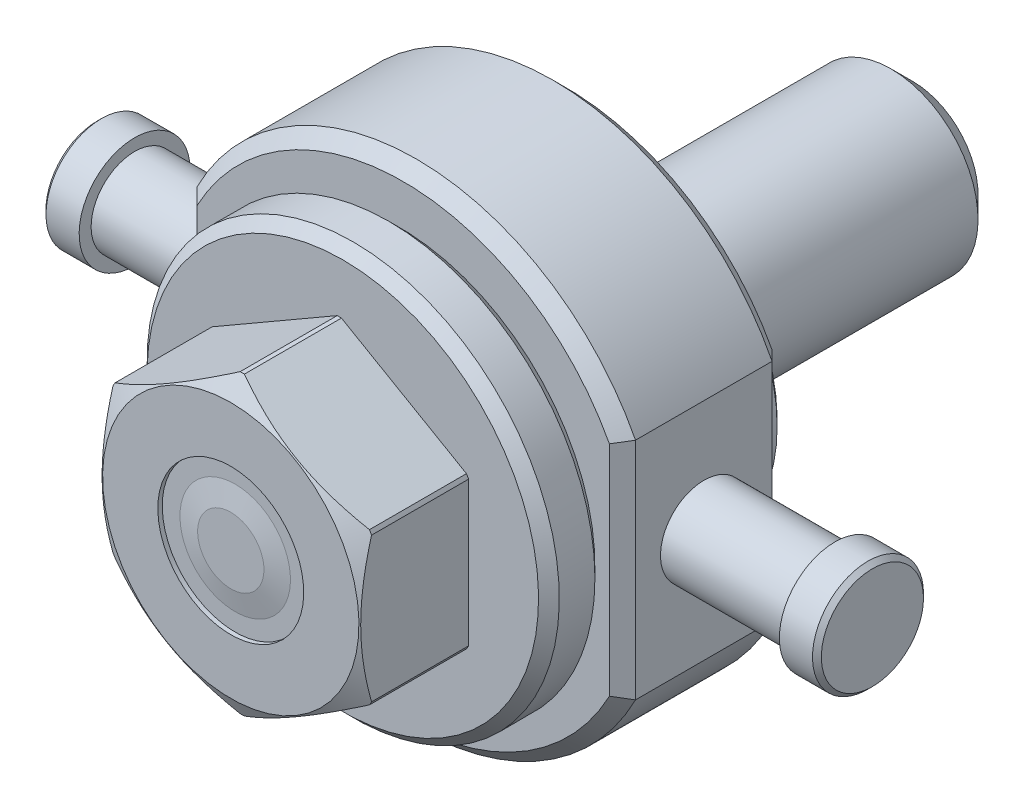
ISO-10303-21;
HEADER;
FILE_DESCRIPTION(('STEP AP214'),'2;1');
FILE_NAME('part.step','',(''),(''),'','','');
FILE_SCHEMA(('AUTOMOTIVE_DESIGN { 1 0 10303 214 1 1 1 1 }'));
ENDSEC;
DATA;
#1=APPLICATION_CONTEXT('core data for automotive mechanical design processes');
#2=APPLICATION_PROTOCOL_DEFINITION('international standard','automotive_design',2000,#1);
#3=PRODUCT_CONTEXT('',#1,'mechanical');
#4=PRODUCT('Part','Part','',(#3));
#5=PRODUCT_RELATED_PRODUCT_CATEGORY('part','',(#4));
#6=PRODUCT_DEFINITION_FORMATION('','',#4);
#7=PRODUCT_DEFINITION_CONTEXT('part definition',#1,'design');
#8=PRODUCT_DEFINITION('design','',#6,#7);
#9=PRODUCT_DEFINITION_SHAPE('','',#8);
#10=(LENGTH_UNIT() NAMED_UNIT(*) SI_UNIT(.MILLI.,.METRE.));
#11=(NAMED_UNIT(*) PLANE_ANGLE_UNIT() SI_UNIT($,.RADIAN.));
#12=(NAMED_UNIT(*) SI_UNIT($,.STERADIAN.) SOLID_ANGLE_UNIT());
#13=UNCERTAINTY_MEASURE_WITH_UNIT(LENGTH_MEASURE(1.E-05),#10,'distance_accuracy_value','');
#14=(GEOMETRIC_REPRESENTATION_CONTEXT(3) GLOBAL_UNCERTAINTY_ASSIGNED_CONTEXT((#13)) GLOBAL_UNIT_ASSIGNED_CONTEXT((#10,
#11,#12)) REPRESENTATION_CONTEXT('',''));
#15=CARTESIAN_POINT('',(0.,0.,0.));
#16=DIRECTION('',(0.,0.,1.));
#17=DIRECTION('',(1.,0.,0.));
#18=AXIS2_PLACEMENT_3D('',#15,#16,#17);
#19=CARTESIAN_POINT('',(-25.2,0.,44.5009030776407));
#20=DIRECTION('',(-1.,0.,0.));
#21=DIRECTION('',(0.,0.,1.));
#22=AXIS2_PLACEMENT_3D('',#19,#20,#21);
#23=PLANE('',#22);
#24=DIRECTION('',(0.,0.,-1.));
#25=VECTOR('',#24,1.);
#26=CARTESIAN_POINT('',(-25.2,-12.9243584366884,24.5618));
#27=LINE('',#26,#25);
#28=CARTESIAN_POINT('',(-25.2,-12.9243584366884,7.3674));
#29=VERTEX_POINT('',#28);
#30=CARTESIAN_POINT('',(-25.2,-12.9243584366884,23.0618));
#31=VERTEX_POINT('',#30);
#32=EDGE_CURVE('E173',#29,#31,#27,.F.);
#33=ORIENTED_EDGE('',*,*,#32,.T.);
#34=DIRECTION('',(0.,1.,0.));
#35=VECTOR('',#34,1.);
#36=CARTESIAN_POINT('',(-25.2,0.,23.0618));
#37=LINE('',#36,#35);
#38=CARTESIAN_POINT('',(-25.2,12.9243584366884,23.0618));
#39=VERTEX_POINT('',#38);
#40=EDGE_CURVE('E9',#31,#39,#37,.T.);
#41=ORIENTED_EDGE('',*,*,#40,.T.);
#42=DIRECTION('',(0.,0.,-1.));
#43=VECTOR('',#42,1.);
#44=CARTESIAN_POINT('',(-25.2,12.9243584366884,24.5618));
#45=LINE('',#44,#43);
#46=CARTESIAN_POINT('',(-25.2,12.9243584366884,7.3674));
#47=VERTEX_POINT('',#46);
#48=EDGE_CURVE('E392',#47,#39,#45,.F.);
#49=ORIENTED_EDGE('',*,*,#48,.F.);
#50=DIRECTION('',(0.,-1.,0.));
#51=VECTOR('',#50,1.);
#52=CARTESIAN_POINT('',(-25.2,-9.18292115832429,7.3674));
#53=LINE('',#52,#51);
#54=EDGE_CURVE('E23',#47,#29,#53,.T.);
#55=ORIENTED_EDGE('',*,*,#54,.T.);
#56=EDGE_LOOP('',(#33,#41,#49,#55));
#57=FACE_BOUND('',#56,.T.);
#58=CARTESIAN_POINT('',(-25.2,0.,15.1892));
#59=DIRECTION('',(-1.,0.,0.));
#60=DIRECTION('',(0.,0.,1.));
#61=AXIS2_PLACEMENT_3D('',#58,#59,#60);
#62=CIRCLE('',#61,5.);
#63=CARTESIAN_POINT('',(-25.2,0.,20.1892));
#64=VERTEX_POINT('',#63);
#65=EDGE_CURVE('E387',#64,#64,#62,.F.);
#66=ORIENTED_EDGE('',*,*,#65,.T.);
#67=EDGE_LOOP('',(#66));
#68=FACE_BOUND('',#67,.T.);
#69=ADVANCED_FACE('F14',(#57,#68),#23,.T.);
#70=CARTESIAN_POINT('',(25.2,0.,44.5009030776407));
#71=DIRECTION('',(1.,0.,0.));
#72=DIRECTION('',(0.,0.,-1.));
#73=AXIS2_PLACEMENT_3D('',#70,#71,#72);
#74=PLANE('',#73);
#75=DIRECTION('',(0.,0.,-1.));
#76=VECTOR('',#75,1.);
#77=CARTESIAN_POINT('',(25.2,12.9243584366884,24.5618));
#78=LINE('',#77,#76);
#79=CARTESIAN_POINT('',(25.2,12.9243584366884,23.0618));
#80=VERTEX_POINT('',#79);
#81=CARTESIAN_POINT('',(25.2,12.9243584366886,7.3674));
#82=VERTEX_POINT('',#81);
#83=EDGE_CURVE('E389',#80,#82,#78,.T.);
#84=ORIENTED_EDGE('',*,*,#83,.F.);
#85=DIRECTION('',(0.,-1.,0.));
#86=VECTOR('',#85,1.);
#87=CARTESIAN_POINT('',(25.2,0.,23.0618));
#88=LINE('',#87,#86);
#89=CARTESIAN_POINT('',(25.2,-12.9243584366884,23.0618));
#90=VERTEX_POINT('',#89);
#91=EDGE_CURVE('E169',#80,#90,#88,.T.);
#92=ORIENTED_EDGE('',*,*,#91,.T.);
#93=DIRECTION('',(0.,0.,-1.));
#94=VECTOR('',#93,1.);
#95=CARTESIAN_POINT('',(25.2,-12.9243584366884,24.5618));
#96=LINE('',#95,#94);
#97=CARTESIAN_POINT('',(25.2,-12.9243584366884,7.3674));
#98=VERTEX_POINT('',#97);
#99=EDGE_CURVE('E162',#90,#98,#96,.T.);
#100=ORIENTED_EDGE('',*,*,#99,.T.);
#101=DIRECTION('',(0.,1.,0.));
#102=VECTOR('',#101,1.);
#103=CARTESIAN_POINT('',(25.2,9.18292115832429,7.3674));
#104=LINE('',#103,#102);
#105=EDGE_CURVE('E166',#98,#82,#104,.T.);
#106=ORIENTED_EDGE('',*,*,#105,.T.);
#107=EDGE_LOOP('',(#84,#92,#100,#106));
#108=FACE_BOUND('',#107,.T.);
#109=CARTESIAN_POINT('',(25.2,0.,15.1892));
#110=DIRECTION('',(1.,0.,0.));
#111=DIRECTION('',(0.,0.,-1.));
#112=AXIS2_PLACEMENT_3D('',#109,#110,#111);
#113=CIRCLE('',#112,5.);
#114=CARTESIAN_POINT('',(25.2,0.,10.1892));
#115=VERTEX_POINT('',#114);
#116=EDGE_CURVE('E390',#115,#115,#113,.F.);
#117=ORIENTED_EDGE('',*,*,#116,.T.);
#118=EDGE_LOOP('',(#117));
#119=FACE_BOUND('',#118,.T.);
#120=ADVANCED_FACE('F164',(#108,#119),#74,.T.);
#121=CARTESIAN_POINT('',(-58.693735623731,0.,15.1892));
#122=DIRECTION('',(1.,0.,0.));
#123=DIRECTION('',(0.,1.,0.));
#124=AXIS2_PLACEMENT_3D('',#121,#122,#123);
#125=CYLINDRICAL_SURFACE('',#124,5.);
#126=ORIENTED_EDGE('',*,*,#65,.F.);
#127=EDGE_LOOP('',(#126));
#128=FACE_BOUND('',#127,.T.);
#129=CARTESIAN_POINT('',(-40.2336,0.,15.1892));
#130=DIRECTION('',(1.,0.,0.));
#131=DIRECTION('',(0.,1.,0.));
#132=AXIS2_PLACEMENT_3D('',#129,#130,#131);
#133=CIRCLE('',#132,5.);
#134=CARTESIAN_POINT('',(-40.2336,5.,15.1892));
#135=VERTEX_POINT('',#134);
#136=EDGE_CURVE('E249',#135,#135,#133,.T.);
#137=ORIENTED_EDGE('',*,*,#136,.T.);
#138=EDGE_LOOP('',(#137));
#139=FACE_BOUND('',#138,.T.);
#140=ADVANCED_FACE('F381',(#128,#139),#125,.T.);
#141=CARTESIAN_POINT('',(0.,0.,24.5618));
#142=DIRECTION('',(0.,0.,1.));
#143=DIRECTION('',(0.,-1.,0.));
#144=AXIS2_PLACEMENT_3D('',#141,#142,#143);
#145=PLANE('',#144);
#146=CARTESIAN_POINT('',(0.,0.,24.5618));
#147=DIRECTION('',(0.,0.,1.));
#148=DIRECTION('',(1.,0.,0.));
#149=AXIS2_PLACEMENT_3D('',#146,#147,#148);
#150=CIRCLE('',#149,26.821);
#151=CARTESIAN_POINT('',(-23.7,-12.5569120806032,24.5618));
#152=VERTEX_POINT('',#151);
#153=CARTESIAN_POINT('',(23.7,-12.5569120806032,24.5618));
#154=VERTEX_POINT('',#153);
#155=EDGE_CURVE('E403',#152,#154,#150,.T.);
#156=ORIENTED_EDGE('',*,*,#155,.T.);
#157=DIRECTION('',(0.,1.,0.));
#158=VECTOR('',#157,1.);
#159=CARTESIAN_POINT('',(23.7,0.,24.5618));
#160=LINE('',#159,#158);
#161=CARTESIAN_POINT('',(23.7,12.5569120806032,24.5618));
#162=VERTEX_POINT('',#161);
#163=EDGE_CURVE('E232',#154,#162,#160,.T.);
#164=ORIENTED_EDGE('',*,*,#163,.T.);
#165=CARTESIAN_POINT('',(-23.7,12.5569120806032,24.5618));
#166=VERTEX_POINT('',#165);
#167=EDGE_CURVE('E400',#162,#166,#150,.T.);
#168=ORIENTED_EDGE('',*,*,#167,.T.);
#169=DIRECTION('',(0.,-1.,0.));
#170=VECTOR('',#169,1.);
#171=CARTESIAN_POINT('',(-23.7,0.,24.5618));
#172=LINE('',#171,#170);
#173=EDGE_CURVE('E235',#166,#152,#172,.T.);
#174=ORIENTED_EDGE('',*,*,#173,.T.);
#175=EDGE_LOOP('',(#156,#164,#168,#174));
#176=FACE_BOUND('',#175,.T.);
#177=CARTESIAN_POINT('',(0.,0.,24.5618));
#178=DIRECTION('',(0.,0.,-1.));
#179=DIRECTION('',(0.,1.,0.));
#180=AXIS2_PLACEMENT_3D('',#177,#178,#179);
#181=CIRCLE('',#180,12.4333);
#182=CARTESIAN_POINT('',(0.,12.4333,24.5618));
#183=VERTEX_POINT('',#182);
#184=EDGE_CURVE('E244',#183,#183,#181,.T.);
#185=ORIENTED_EDGE('',*,*,#184,.T.);
#186=EDGE_LOOP('',(#185));
#187=FACE_BOUND('',#186,.T.);
#188=ADVANCED_FACE('F217',(#176,#187),#145,.T.);
#189=CARTESIAN_POINT('',(0.,0.,23.0618));
#190=DIRECTION('',(0.,0.,-1.));
#191=DIRECTION('',(-1.,0.,0.));
#192=AXIS2_PLACEMENT_3D('',#189,#190,#191);
#193=CONICAL_SURFACE('',#192,28.321,0.785398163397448);
#194=ORIENTED_EDGE('',*,*,#167,.F.);
#195=CARTESIAN_POINT('',(23.7,12.5569120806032,24.5618));
#196=CARTESIAN_POINT('',(23.9498950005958,12.6190104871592,24.3119049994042));
#197=CARTESIAN_POINT('',(24.1998425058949,12.6806802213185,24.0619574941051));
#198=CARTESIAN_POINT('',(24.6998425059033,12.803162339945,23.5619574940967));
#199=CARTESIAN_POINT('',(24.9498950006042,12.8639747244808,23.3119049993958));
#200=CARTESIAN_POINT('',(25.2,12.9243584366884,23.0618));
#201=B_SPLINE_CURVE_WITH_KNOTS('',3,(#195,#196,#197,#198,#199,#200),.UNSPECIFIED.,.F.,.F.,(4,2,
4),(0.,1.07645529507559,2.15291050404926),.UNSPECIFIED.);
#202=EDGE_CURVE('E183',#162,#80,#201,.T.);
#203=ORIENTED_EDGE('',*,*,#202,.T.);
#204=CARTESIAN_POINT('',(0.,0.,23.0618));
#205=DIRECTION('',(0.,0.,1.));
#206=DIRECTION('',(1.,0.,0.));
#207=AXIS2_PLACEMENT_3D('',#204,#205,#206);
#208=CIRCLE('',#207,28.321);
#209=EDGE_CURVE('E178',#80,#39,#208,.T.);
#210=ORIENTED_EDGE('',*,*,#209,.T.);
#211=CARTESIAN_POINT('',(-25.2,12.9243584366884,23.0618));
#212=CARTESIAN_POINT('',(-24.9498950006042,12.8639747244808,23.3119049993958));
#213=CARTESIAN_POINT('',(-24.6998425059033,12.803162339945,23.5619574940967));
#214=CARTESIAN_POINT('',(-24.1998425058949,12.6806802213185,24.0619574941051));
#215=CARTESIAN_POINT('',(-23.9498950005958,12.6190104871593,24.3119049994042));
#216=CARTESIAN_POINT('',(-23.7,12.5569120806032,24.5618));
#217=B_SPLINE_CURVE_WITH_KNOTS('',3,(#211,#212,#213,#214,#215,#216),.UNSPECIFIED.,.F.,.F.,(4,2,
4),(0.,1.07645520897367,2.15291050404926),.UNSPECIFIED.);
#218=EDGE_CURVE('E187',#39,#166,#217,.T.);
#219=ORIENTED_EDGE('',*,*,#218,.T.);
#220=EDGE_LOOP('',(#194,#203,#210,#219));
#221=FACE_BOUND('',#220,.T.);
#222=ADVANCED_FACE('F211',(#221),#193,.T.);
#223=EDGE_CURVE('E406',#31,#90,#208,.T.);
#224=ORIENTED_EDGE('',*,*,#223,.T.);
#225=CARTESIAN_POINT('',(25.2,-12.9243584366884,23.0618));
#226=CARTESIAN_POINT('',(24.9498950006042,-12.8639747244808,23.3119049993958));
#227=CARTESIAN_POINT('',(24.6998425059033,-12.803162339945,23.5619574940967));
#228=CARTESIAN_POINT('',(24.1998425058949,-12.6806802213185,24.0619574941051));
#229=CARTESIAN_POINT('',(23.9498950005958,-12.6190104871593,24.3119049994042));
#230=CARTESIAN_POINT('',(23.7,-12.5569120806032,24.5618));
#231=B_SPLINE_CURVE_WITH_KNOTS('',3,(#225,#226,#227,#228,#229,#230),.UNSPECIFIED.,.F.,.F.,(4,2,
4),(0.,1.07645520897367,2.15291050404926),.UNSPECIFIED.);
#232=EDGE_CURVE('E202',#90,#154,#231,.T.);
#233=ORIENTED_EDGE('',*,*,#232,.T.);
#234=ORIENTED_EDGE('',*,*,#155,.F.);
#235=CARTESIAN_POINT('',(-23.7,-12.5569120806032,24.5618));
#236=CARTESIAN_POINT('',(-23.9498950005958,-12.6190104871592,24.3119049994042));
#237=CARTESIAN_POINT('',(-24.1998425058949,-12.6806802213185,24.0619574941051));
#238=CARTESIAN_POINT('',(-24.6998425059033,-12.803162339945,23.5619574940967));
#239=CARTESIAN_POINT('',(-24.9498950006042,-12.8639747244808,23.3119049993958));
#240=CARTESIAN_POINT('',(-25.2,-12.9243584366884,23.0618));
#241=B_SPLINE_CURVE_WITH_KNOTS('',3,(#235,#236,#237,#238,#239,#240),.UNSPECIFIED.,.F.,.F.,(4,2,
4),(0.,1.07645529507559,2.15291050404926),.UNSPECIFIED.);
#242=EDGE_CURVE('E185',#152,#31,#241,.T.);
#243=ORIENTED_EDGE('',*,*,#242,.T.);
#244=EDGE_LOOP('',(#224,#233,#234,#243));
#245=FACE_BOUND('',#244,.T.);
#246=ADVANCED_FACE('F216',(#245),#193,.T.);
#247=CARTESIAN_POINT('',(0.,0.,5.8674));
#248=DIRECTION('',(0.,0.,1.));
#249=DIRECTION('',(1.,0.,0.));
#250=AXIS2_PLACEMENT_3D('',#247,#248,#249);
#251=CONICAL_SURFACE('',#250,26.821,0.785398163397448);
#252=CARTESIAN_POINT('',(0.,0.,7.3674));
#253=DIRECTION('',(0.,0.,1.));
#254=DIRECTION('',(1.,0.,0.));
#255=AXIS2_PLACEMENT_3D('',#252,#253,#254);
#256=CIRCLE('',#255,28.321);
#257=EDGE_CURVE('E179',#82,#47,#256,.T.);
#258=ORIENTED_EDGE('',*,*,#257,.F.);
#259=CARTESIAN_POINT('',(25.2,12.9243584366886,7.3674));
#260=CARTESIAN_POINT('',(24.9498950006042,12.8639747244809,7.11729500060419));
#261=CARTESIAN_POINT('',(24.6998425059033,12.803162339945,6.86724250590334));
#262=CARTESIAN_POINT('',(24.1998425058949,12.6806802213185,6.36724250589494));
#263=CARTESIAN_POINT('',(23.9498950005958,12.6190104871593,6.11729500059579));
#264=CARTESIAN_POINT('',(23.7,12.5569120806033,5.8674));
#265=B_SPLINE_CURVE_WITH_KNOTS('',3,(#259,#260,#261,#262,#263,#264),.UNSPECIFIED.,.F.,.F.,(4,2,
4),(0.,1.07645520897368,2.15291050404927),.UNSPECIFIED.);
#266=CARTESIAN_POINT('',(23.7,12.5569120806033,5.8674));
#267=VERTEX_POINT('',#266);
#268=EDGE_CURVE('E182',#82,#267,#265,.T.);
#269=ORIENTED_EDGE('',*,*,#268,.T.);
#270=CARTESIAN_POINT('',(0.,0.,5.8674));
#271=DIRECTION('',(0.,0.,1.));
#272=DIRECTION('',(1.,0.,0.));
#273=AXIS2_PLACEMENT_3D('',#270,#271,#272);
#274=CIRCLE('',#273,26.821);
#275=CARTESIAN_POINT('',(-23.7,12.5569120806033,5.8674));
#276=VERTEX_POINT('',#275);
#277=EDGE_CURVE('E404',#267,#276,#274,.T.);
#278=ORIENTED_EDGE('',*,*,#277,.T.);
#279=CARTESIAN_POINT('',(-23.7,12.5569120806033,5.8674));
#280=CARTESIAN_POINT('',(-23.9498950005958,12.6190104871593,6.11729500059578));
#281=CARTESIAN_POINT('',(-24.1998425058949,12.6806802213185,6.36724250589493));
#282=CARTESIAN_POINT('',(-24.6998425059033,12.803162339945,6.86724250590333));
#283=CARTESIAN_POINT('',(-24.9498950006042,12.8639747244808,7.11729500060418));
#284=CARTESIAN_POINT('',(-25.2,12.9243584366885,7.3674));
#285=B_SPLINE_CURVE_WITH_KNOTS('',3,(#279,#280,#281,#282,#283,#284),.UNSPECIFIED.,.F.,.F.,(4,2,
4),(0.,1.07645529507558,2.15291050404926),.UNSPECIFIED.);
#286=EDGE_CURVE('E610',#276,#47,#285,.T.);
#287=ORIENTED_EDGE('',*,*,#286,.T.);
#288=EDGE_LOOP('',(#258,#269,#278,#287));
#289=FACE_BOUND('',#288,.T.);
#290=ADVANCED_FACE('F219',(#289),#251,.T.);
#291=CARTESIAN_POINT('',(-23.7,-12.5569120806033,5.8674));
#292=VERTEX_POINT('',#291);
#293=CARTESIAN_POINT('',(23.7,-12.5569120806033,5.8674));
#294=VERTEX_POINT('',#293);
#295=EDGE_CURVE('E155',#292,#294,#274,.T.);
#296=ORIENTED_EDGE('',*,*,#295,.T.);
#297=CARTESIAN_POINT('',(23.7,-12.5569120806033,5.8674));
#298=CARTESIAN_POINT('',(23.9498950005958,-12.6190104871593,6.11729500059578));
#299=CARTESIAN_POINT('',(24.1998425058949,-12.6806802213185,6.36724250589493));
#300=CARTESIAN_POINT('',(24.6998425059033,-12.803162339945,6.86724250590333));
#301=CARTESIAN_POINT('',(24.9498950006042,-12.8639747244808,7.11729500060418));
#302=CARTESIAN_POINT('',(25.2,-12.9243584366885,7.3674));
#303=B_SPLINE_CURVE_WITH_KNOTS('',3,(#297,#298,#299,#300,#301,#302),.UNSPECIFIED.,.F.,.F.,(4,2,
4),(0.,1.07645529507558,2.15291050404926),.UNSPECIFIED.);
#304=EDGE_CURVE('E150',#294,#98,#303,.T.);
#305=ORIENTED_EDGE('',*,*,#304,.T.);
#306=EDGE_CURVE('E154',#29,#98,#256,.T.);
#307=ORIENTED_EDGE('',*,*,#306,.F.);
#308=CARTESIAN_POINT('',(-25.2,-12.9243584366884,7.3674));
#309=CARTESIAN_POINT('',(-24.9498950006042,-12.8639747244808,7.11729500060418));
#310=CARTESIAN_POINT('',(-24.6998425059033,-12.803162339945,6.86724250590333));
#311=CARTESIAN_POINT('',(-24.1998425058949,-12.6806802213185,6.36724250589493));
#312=CARTESIAN_POINT('',(-23.9498950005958,-12.6190104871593,6.11729500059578));
#313=CARTESIAN_POINT('',(-23.7,-12.5569120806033,5.8674));
#314=B_SPLINE_CURVE_WITH_KNOTS('',3,(#308,#309,#310,#311,#312,#313),.UNSPECIFIED.,.F.,.F.,(4,2,
4),(0.,1.07645520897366,2.15291050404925),.UNSPECIFIED.);
#315=EDGE_CURVE('E37',#29,#292,#314,.T.);
#316=ORIENTED_EDGE('',*,*,#315,.T.);
#317=EDGE_LOOP('',(#296,#305,#307,#316));
#318=FACE_BOUND('',#317,.T.);
#319=ADVANCED_FACE('F152',(#318),#251,.T.);
#320=CARTESIAN_POINT('',(0.,0.,24.5618));
#321=DIRECTION('',(0.,0.,-1.));
#322=DIRECTION('',(0.,1.,0.));
#323=AXIS2_PLACEMENT_3D('',#320,#321,#322);
#324=CYLINDRICAL_SURFACE('',#323,28.321);
#325=ORIENTED_EDGE('',*,*,#209,.F.);
#326=ORIENTED_EDGE('',*,*,#83,.T.);
#327=ORIENTED_EDGE('',*,*,#257,.T.);
#328=ORIENTED_EDGE('',*,*,#48,.T.);
#329=EDGE_LOOP('',(#325,#326,#327,#328));
#330=FACE_BOUND('',#329,.T.);
#331=ADVANCED_FACE('F632',(#330),#324,.T.);
#332=ORIENTED_EDGE('',*,*,#99,.F.);
#333=ORIENTED_EDGE('',*,*,#223,.F.);
#334=ORIENTED_EDGE('',*,*,#32,.F.);
#335=ORIENTED_EDGE('',*,*,#306,.T.);
#336=EDGE_LOOP('',(#332,#333,#334,#335));
#337=FACE_BOUND('',#336,.T.);
#338=ADVANCED_FACE('F176',(#337),#324,.T.);
#339=CARTESIAN_POINT('',(0.,0.,5.8674));
#340=DIRECTION('',(0.,0.,1.));
#341=DIRECTION('',(0.,-1.,0.));
#342=AXIS2_PLACEMENT_3D('',#339,#340,#341);
#343=PLANE('',#342);
#344=CARTESIAN_POINT('',(0.,0.,5.8674));
#345=DIRECTION('',(0.,0.,-1.));
#346=DIRECTION('',(0.,1.,0.));
#347=AXIS2_PLACEMENT_3D('',#344,#345,#346);
#348=CIRCLE('',#347,18.415);
#349=CARTESIAN_POINT('',(0.,18.415,5.8674));
#350=VERTEX_POINT('',#349);
#351=EDGE_CURVE('E420',#350,#350,#348,.T.);
#352=ORIENTED_EDGE('',*,*,#351,.F.);
#353=EDGE_LOOP('',(#352));
#354=FACE_BOUND('',#353,.T.);
#355=ORIENTED_EDGE('',*,*,#277,.F.);
#356=DIRECTION('',(0.,-1.,0.));
#357=VECTOR('',#356,1.);
#358=CARTESIAN_POINT('',(23.7,-9.18292115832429,5.8674));
#359=LINE('',#358,#357);
#360=EDGE_CURVE('E30',#267,#294,#359,.T.);
#361=ORIENTED_EDGE('',*,*,#360,.T.);
#362=ORIENTED_EDGE('',*,*,#295,.F.);
#363=DIRECTION('',(0.,1.,0.));
#364=VECTOR('',#363,1.);
#365=CARTESIAN_POINT('',(-23.7,9.18292115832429,5.8674));
#366=LINE('',#365,#364);
#367=EDGE_CURVE('E611',#292,#276,#366,.T.);
#368=ORIENTED_EDGE('',*,*,#367,.T.);
#369=EDGE_LOOP('',(#355,#361,#362,#368));
#370=FACE_BOUND('',#369,.T.);
#371=ADVANCED_FACE('F570',(#354,#370),#343,.F.);
#372=CARTESIAN_POINT('',(40.2336,0.,15.1892));
#373=DIRECTION('',(-1.,0.,0.));
#374=DIRECTION('',(0.,-1.,0.));
#375=AXIS2_PLACEMENT_3D('',#372,#373,#374);
#376=CIRCLE('',#375,5.);
#377=CARTESIAN_POINT('',(40.2336,-4.99999999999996,15.1892));
#378=VERTEX_POINT('',#377);
#379=EDGE_CURVE('E411',#378,#378,#376,.T.);
#380=ORIENTED_EDGE('',*,*,#379,.T.);
#381=EDGE_LOOP('',(#380));
#382=FACE_BOUND('',#381,.T.);
#383=ORIENTED_EDGE('',*,*,#116,.F.);
#384=EDGE_LOOP('',(#383));
#385=FACE_BOUND('',#384,.T.);
#386=ADVANCED_FACE('F558',(#382,#385),#125,.T.);
#387=CARTESIAN_POINT('',(0.,-14.732,44.3738));
#388=DIRECTION('',(0.,0.,1.));
#389=DIRECTION('',(0.,-1.,0.));
#390=AXIS2_PLACEMENT_3D('',#387,#388,#389);
#391=PLANE('',#390);
#392=CARTESIAN_POINT('',(0.,0.,44.3738000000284));
#393=DIRECTION('',(0.,0.,-1.));
#394=DIRECTION('',(0.,1.,0.));
#395=AXIS2_PLACEMENT_3D('',#392,#393,#394);
#396=CIRCLE('',#395,3.80999999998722);
#397=CARTESIAN_POINT('',(0.,3.80999999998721,44.3738000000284));
#398=VERTEX_POINT('',#397);
#399=EDGE_CURVE('E245',#398,#398,#396,.T.);
#400=ORIENTED_EDGE('',*,*,#399,.F.);
#401=EDGE_LOOP('',(#400));
#402=FACE_BOUND('',#401,.T.);
#403=ADVANCED_FACE('F548',(#402),#391,.T.);
#404=CARTESIAN_POINT('',(0.,0.,43.8658000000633));
#405=DIRECTION('',(0.,0.,-1.));
#406=DIRECTION('',(0.,1.,0.));
#407=AXIS2_PLACEMENT_3D('',#404,#405,#406);
#408=CONICAL_SURFACE('',#407,6.34999999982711,1.37340076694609);
#409=ORIENTED_EDGE('',*,*,#399,.T.);
#410=EDGE_LOOP('',(#409));
#411=FACE_BOUND('',#410,.T.);
#412=CARTESIAN_POINT('',(0.,0.,43.8658000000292));
#413=DIRECTION('',(0.,0.,-1.));
#414=DIRECTION('',(0.,1.,0.));
#415=AXIS2_PLACEMENT_3D('',#412,#413,#414);
#416=CIRCLE('',#415,6.34999999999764);
#417=CARTESIAN_POINT('',(0.,6.34999999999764,43.8658000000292));
#418=VERTEX_POINT('',#417);
#419=EDGE_CURVE('E248',#418,#418,#416,.T.);
#420=ORIENTED_EDGE('',*,*,#419,.F.);
#421=EDGE_LOOP('',(#420));
#422=FACE_BOUND('',#421,.T.);
#423=ADVANCED_FACE('F560',(#411,#422),#408,.T.);
#424=CARTESIAN_POINT('',(6.35,0.,43.8658));
#425=DIRECTION('',(0.,0.,1.));
#426=DIRECTION('',(0.,-1.,0.));
#427=AXIS2_PLACEMENT_3D('',#424,#425,#426);
#428=PLANE('',#427);
#429=CARTESIAN_POINT('',(0.,0.,43.8658));
#430=DIRECTION('',(0.,0.,-1.));
#431=DIRECTION('',(0.,1.,0.));
#432=AXIS2_PLACEMENT_3D('',#429,#430,#431);
#433=CIRCLE('',#432,8.382);
#434=CARTESIAN_POINT('',(0.,8.382,43.8658));
#435=VERTEX_POINT('',#434);
#436=EDGE_CURVE('E252',#435,#435,#433,.F.);
#437=ORIENTED_EDGE('',*,*,#436,.T.);
#438=EDGE_LOOP('',(#437));
#439=FACE_BOUND('',#438,.T.);
#440=ORIENTED_EDGE('',*,*,#419,.T.);
#441=EDGE_LOOP('',(#440));
#442=FACE_BOUND('',#441,.T.);
#443=ADVANCED_FACE('F567',(#439,#442),#428,.T.);
#444=CARTESIAN_POINT('',(0.,0.,2.667));
#445=DIRECTION('',(0.,0.,-1.));
#446=DIRECTION('',(0.,1.,0.));
#447=AXIS2_PLACEMENT_3D('',#444,#445,#446);
#448=CYLINDRICAL_SURFACE('',#447,8.382);
#449=ORIENTED_EDGE('',*,*,#436,.F.);
#450=EDGE_LOOP('',(#449));
#451=FACE_BOUND('',#450,.T.);
#452=CARTESIAN_POINT('',(0.,0.,44.3738));
#453=DIRECTION('',(0.,0.,-1.));
#454=DIRECTION('',(0.,1.,0.));
#455=AXIS2_PLACEMENT_3D('',#452,#453,#454);
#456=CIRCLE('',#455,8.382);
#457=CARTESIAN_POINT('',(0.,8.382,44.3738));
#458=VERTEX_POINT('',#457);
#459=EDGE_CURVE('E255',#458,#458,#456,.T.);
#460=ORIENTED_EDGE('',*,*,#459,.F.);
#461=EDGE_LOOP('',(#460));
#462=FACE_BOUND('',#461,.T.);
#463=ADVANCED_FACE('F963',(#451,#462),#448,.F.);
#464=CARTESIAN_POINT('',(0.,-14.732,44.3738));
#465=DIRECTION('',(0.,0.,1.));
#466=DIRECTION('',(0.,-1.,0.));
#467=AXIS2_PLACEMENT_3D('',#464,#465,#466);
#468=PLANE('',#467);
#469=ORIENTED_EDGE('',*,*,#459,.T.);
#470=EDGE_LOOP('',(#469));
#471=FACE_BOUND('',#470,.T.);
#472=CARTESIAN_POINT('',(0.,0.,44.3738));
#473=DIRECTION('',(0.,0.,-1.));
#474=DIRECTION('',(0.,1.,0.));
#475=AXIS2_PLACEMENT_3D('',#472,#473,#474);
#476=CIRCLE('',#475,14.732);
#477=CARTESIAN_POINT('',(0.,14.732,44.3738));
#478=VERTEX_POINT('',#477);
#479=EDGE_CURVE('E269',#478,#478,#476,.T.);
#480=ORIENTED_EDGE('',*,*,#479,.F.);
#481=EDGE_LOOP('',(#480));
#482=FACE_BOUND('',#481,.T.);
#483=ADVANCED_FACE('F953',(#471,#482),#468,.T.);
#484=CARTESIAN_POINT('',(0.,0.,-33.528));
#485=DIRECTION('',(0.,0.,1.));
#486=DIRECTION('',(0.,-1.,0.));
#487=AXIS2_PLACEMENT_3D('',#484,#485,#486);
#488=CYLINDRICAL_SURFACE('',#487,17.018);
#489=CARTESIAN_POINT('',(0.,0.,43.0539772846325));
#490=DIRECTION('',(0.,0.,-1.));
#491=DIRECTION('',(0.,1.,0.));
#492=AXIS2_PLACEMENT_3D('',#489,#490,#491);
#493=CIRCLE('',#492,17.018);
#494=CARTESIAN_POINT('',(-14.6139855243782,8.72030682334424,43.0539772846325));
#495=VERTEX_POINT('',#494);
#496=CARTESIAN_POINT('',(-14.859,8.29592930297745,43.0539772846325));
#497=VERTEX_POINT('',#496);
#498=EDGE_CURVE('E492',#495,#497,#493,.F.);
#499=ORIENTED_EDGE('',*,*,#498,.F.);
#500=DIRECTION('',(0.,0.,1.));
#501=VECTOR('',#500,1.);
#502=CARTESIAN_POINT('',(-14.6139855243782,8.72030682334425,-33.528));
#503=LINE('',#502,#501);
#504=CARTESIAN_POINT('',(-14.6139855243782,8.72030682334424,31.9024));
#505=VERTEX_POINT('',#504);
#506=EDGE_CURVE('E482',#505,#495,#503,.T.);
#507=ORIENTED_EDGE('',*,*,#506,.F.);
#508=CARTESIAN_POINT('',(0.,0.,31.9024));
#509=DIRECTION('',(0.,0.,1.));
#510=DIRECTION('',(0.,-1.,0.));
#511=AXIS2_PLACEMENT_3D('',#508,#509,#510);
#512=CIRCLE('',#511,17.018);
#513=CARTESIAN_POINT('',(-14.859,8.29592930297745,31.9024));
#514=VERTEX_POINT('',#513);
#515=EDGE_CURVE('E258',#505,#514,#512,.T.);
#516=ORIENTED_EDGE('',*,*,#515,.T.);
#517=DIRECTION('',(0.,0.,1.));
#518=VECTOR('',#517,1.);
#519=CARTESIAN_POINT('',(-14.859,8.29592930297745,-33.528));
#520=LINE('',#519,#518);
#521=EDGE_CURVE('E287',#497,#514,#520,.F.);
#522=ORIENTED_EDGE('',*,*,#521,.F.);
#523=EDGE_LOOP('',(#499,#507,#516,#522));
#524=FACE_BOUND('',#523,.T.);
#525=ADVANCED_FACE('F943',(#524),#488,.T.);
#526=CARTESIAN_POINT('',(0.,0.,-33.528));
#527=DIRECTION('',(0.,0.,1.));
#528=DIRECTION('',(0.,-1.,0.));
#529=AXIS2_PLACEMENT_3D('',#526,#527,#528);
#530=CYLINDRICAL_SURFACE('',#529,17.018);
#531=CARTESIAN_POINT('',(0.,0.,43.0539772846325));
#532=DIRECTION('',(0.,0.,-1.));
#533=DIRECTION('',(0.,1.,0.));
#534=AXIS2_PLACEMENT_3D('',#531,#532,#533);
#535=CIRCLE('',#534,17.018);
#536=CARTESIAN_POINT('',(0.245014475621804,17.0162361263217,43.0539772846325));
#537=VERTEX_POINT('',#536);
#538=CARTESIAN_POINT('',(-0.245014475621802,17.0162361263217,43.0539772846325));
#539=VERTEX_POINT('',#538);
#540=EDGE_CURVE('E273',#537,#539,#535,.F.);
#541=ORIENTED_EDGE('',*,*,#540,.F.);
#542=DIRECTION('',(0.,0.,1.));
#543=VECTOR('',#542,1.);
#544=CARTESIAN_POINT('',(0.245014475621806,17.0162361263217,-33.528));
#545=LINE('',#544,#543);
#546=CARTESIAN_POINT('',(0.245014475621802,17.0162361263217,31.9024));
#547=VERTEX_POINT('',#546);
#548=EDGE_CURVE('E477',#547,#537,#545,.T.);
#549=ORIENTED_EDGE('',*,*,#548,.F.);
#550=CARTESIAN_POINT('',(0.,0.,31.9024));
#551=DIRECTION('',(0.,0.,1.));
#552=DIRECTION('',(0.,-1.,0.));
#553=AXIS2_PLACEMENT_3D('',#550,#551,#552);
#554=CIRCLE('',#553,17.018);
#555=CARTESIAN_POINT('',(-0.245014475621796,17.0162361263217,31.9024));
#556=VERTEX_POINT('',#555);
#557=EDGE_CURVE('E260',#547,#556,#554,.T.);
#558=ORIENTED_EDGE('',*,*,#557,.T.);
#559=DIRECTION('',(0.,0.,1.));
#560=VECTOR('',#559,1.);
#561=CARTESIAN_POINT('',(-0.245014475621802,17.0162361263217,-33.528));
#562=LINE('',#561,#560);
#563=EDGE_CURVE('E480',#539,#556,#562,.F.);
#564=ORIENTED_EDGE('',*,*,#563,.F.);
#565=EDGE_LOOP('',(#541,#549,#558,#564));
#566=FACE_BOUND('',#565,.T.);
#567=ADVANCED_FACE('F933',(#566),#530,.T.);
#568=CARTESIAN_POINT('',(0.,0.,-33.528));
#569=DIRECTION('',(0.,0.,1.));
#570=DIRECTION('',(0.,-1.,0.));
#571=AXIS2_PLACEMENT_3D('',#568,#569,#570);
#572=CYLINDRICAL_SURFACE('',#571,17.018);
#573=CARTESIAN_POINT('',(0.,0.,43.0539772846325));
#574=DIRECTION('',(0.,0.,-1.));
#575=DIRECTION('',(0.,1.,0.));
#576=AXIS2_PLACEMENT_3D('',#573,#574,#575);
#577=CIRCLE('',#576,17.018);
#578=CARTESIAN_POINT('',(14.859,8.29592930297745,43.0539772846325));
#579=VERTEX_POINT('',#578);
#580=CARTESIAN_POINT('',(14.6139855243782,8.72030682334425,43.0539772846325));
#581=VERTEX_POINT('',#580);
#582=EDGE_CURVE('E270',#579,#581,#577,.F.);
#583=ORIENTED_EDGE('',*,*,#582,.F.);
#584=DIRECTION('',(0.,0.,1.));
#585=VECTOR('',#584,1.);
#586=CARTESIAN_POINT('',(14.859,8.29592930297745,-33.528));
#587=LINE('',#586,#585);
#588=CARTESIAN_POINT('',(14.859,8.29592930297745,31.9024));
#589=VERTEX_POINT('',#588);
#590=EDGE_CURVE('E471',#589,#579,#587,.T.);
#591=ORIENTED_EDGE('',*,*,#590,.F.);
#592=CARTESIAN_POINT('',(0.,0.,31.9024));
#593=DIRECTION('',(0.,0.,1.));
#594=DIRECTION('',(0.,-1.,0.));
#595=AXIS2_PLACEMENT_3D('',#592,#593,#594);
#596=CIRCLE('',#595,17.018);
#597=CARTESIAN_POINT('',(14.6139855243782,8.72030682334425,31.9024));
#598=VERTEX_POINT('',#597);
#599=EDGE_CURVE('E262',#589,#598,#596,.T.);
#600=ORIENTED_EDGE('',*,*,#599,.T.);
#601=DIRECTION('',(0.,0.,1.));
#602=VECTOR('',#601,1.);
#603=CARTESIAN_POINT('',(14.6139855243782,8.72030682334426,-33.528));
#604=LINE('',#603,#602);
#605=EDGE_CURVE('E474',#581,#598,#604,.F.);
#606=ORIENTED_EDGE('',*,*,#605,.F.);
#607=EDGE_LOOP('',(#583,#591,#600,#606));
#608=FACE_BOUND('',#607,.T.);
#609=ADVANCED_FACE('F924',(#608),#572,.T.);
#610=CARTESIAN_POINT('',(0.,0.,-33.528));
#611=DIRECTION('',(0.,0.,1.));
#612=DIRECTION('',(0.,-1.,0.));
#613=AXIS2_PLACEMENT_3D('',#610,#611,#612);
#614=CYLINDRICAL_SURFACE('',#613,17.018);
#615=CARTESIAN_POINT('',(0.,0.,43.0539772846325));
#616=DIRECTION('',(0.,0.,-1.));
#617=DIRECTION('',(0.,1.,0.));
#618=AXIS2_PLACEMENT_3D('',#615,#616,#617);
#619=CIRCLE('',#618,17.018);
#620=CARTESIAN_POINT('',(14.6139855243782,-8.72030682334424,43.0539772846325));
#621=VERTEX_POINT('',#620);
#622=CARTESIAN_POINT('',(14.859,-8.29592930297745,43.0539772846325));
#623=VERTEX_POINT('',#622);
#624=EDGE_CURVE('E266',#621,#623,#619,.F.);
#625=ORIENTED_EDGE('',*,*,#624,.F.);
#626=DIRECTION('',(0.,0.,1.));
#627=VECTOR('',#626,1.);
#628=CARTESIAN_POINT('',(14.6139855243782,-8.72030682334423,-33.528));
#629=LINE('',#628,#627);
#630=CARTESIAN_POINT('',(14.6139855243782,-8.72030682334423,31.9024));
#631=VERTEX_POINT('',#630);
#632=EDGE_CURVE('E465',#631,#621,#629,.T.);
#633=ORIENTED_EDGE('',*,*,#632,.F.);
#634=CARTESIAN_POINT('',(0.,0.,31.9024));
#635=DIRECTION('',(0.,0.,1.));
#636=DIRECTION('',(0.,-1.,0.));
#637=AXIS2_PLACEMENT_3D('',#634,#635,#636);
#638=CIRCLE('',#637,17.018);
#639=CARTESIAN_POINT('',(14.859,-8.29592930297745,31.9024));
#640=VERTEX_POINT('',#639);
#641=EDGE_CURVE('E264',#631,#640,#638,.T.);
#642=ORIENTED_EDGE('',*,*,#641,.T.);
#643=DIRECTION('',(0.,0.,1.));
#644=VECTOR('',#643,1.);
#645=CARTESIAN_POINT('',(14.859,-8.29592930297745,-33.528));
#646=LINE('',#645,#644);
#647=EDGE_CURVE('E468',#623,#640,#646,.F.);
#648=ORIENTED_EDGE('',*,*,#647,.F.);
#649=EDGE_LOOP('',(#625,#633,#642,#648));
#650=FACE_BOUND('',#649,.T.);
#651=ADVANCED_FACE('F915',(#650),#614,.T.);
#652=CARTESIAN_POINT('',(0.,0.,-33.528));
#653=DIRECTION('',(0.,0.,1.));
#654=DIRECTION('',(0.,-1.,0.));
#655=AXIS2_PLACEMENT_3D('',#652,#653,#654);
#656=CYLINDRICAL_SURFACE('',#655,17.018);
#657=CARTESIAN_POINT('',(0.,0.,43.0539772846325));
#658=DIRECTION('',(0.,0.,-1.));
#659=DIRECTION('',(0.,1.,0.));
#660=AXIS2_PLACEMENT_3D('',#657,#658,#659);
#661=CIRCLE('',#660,17.018);
#662=CARTESIAN_POINT('',(-0.245014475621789,-17.0162361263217,43.0539772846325));
#663=VERTEX_POINT('',#662);
#664=CARTESIAN_POINT('',(0.245014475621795,-17.0162361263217,43.0539772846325));
#665=VERTEX_POINT('',#664);
#666=EDGE_CURVE('E490',#663,#665,#661,.F.);
#667=ORIENTED_EDGE('',*,*,#666,.F.);
#668=DIRECTION('',(0.,0.,1.));
#669=VECTOR('',#668,1.);
#670=CARTESIAN_POINT('',(-0.245014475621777,-17.0162361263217,-33.528));
#671=LINE('',#670,#669);
#672=CARTESIAN_POINT('',(-0.245014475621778,-17.0162361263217,31.9024));
#673=VERTEX_POINT('',#672);
#674=EDGE_CURVE('E343',#673,#663,#671,.T.);
#675=ORIENTED_EDGE('',*,*,#674,.F.);
#676=CARTESIAN_POINT('',(0.,0.,31.9024));
#677=DIRECTION('',(0.,0.,1.));
#678=DIRECTION('',(0.,-1.,0.));
#679=AXIS2_PLACEMENT_3D('',#676,#677,#678);
#680=CIRCLE('',#679,17.018);
#681=CARTESIAN_POINT('',(0.245014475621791,-17.0162361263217,31.9024));
#682=VERTEX_POINT('',#681);
#683=EDGE_CURVE('E267',#673,#682,#680,.T.);
#684=ORIENTED_EDGE('',*,*,#683,.T.);
#685=DIRECTION('',(0.,0.,1.));
#686=VECTOR('',#685,1.);
#687=CARTESIAN_POINT('',(0.245014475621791,-17.0162361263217,-33.528));
#688=LINE('',#687,#686);
#689=EDGE_CURVE('E462',#665,#682,#688,.F.);
#690=ORIENTED_EDGE('',*,*,#689,.F.);
#691=EDGE_LOOP('',(#667,#675,#684,#690));
#692=FACE_BOUND('',#691,.T.);
#693=ADVANCED_FACE('F304',(#692),#656,.T.);
#694=CARTESIAN_POINT('',(0.,0.,43.0539772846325));
#695=DIRECTION('',(0.,0.,-1.));
#696=DIRECTION('',(0.,1.,0.));
#697=AXIS2_PLACEMENT_3D('',#694,#695,#696);
#698=CONICAL_SURFACE('',#697,17.018,1.0471975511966);
#699=ORIENTED_EDGE('',*,*,#479,.T.);
#700=EDGE_LOOP('',(#699));
#701=FACE_BOUND('',#700,.T.);
#702=CARTESIAN_POINT('',(-0.245014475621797,-17.0162361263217,43.0539772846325));
#703=CARTESIAN_POINT('',(-0.569572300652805,-16.8288525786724,43.1594475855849));
#704=CARTESIAN_POINT('',(-0.895393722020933,-16.6407394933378,43.2598937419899));
#705=CARTESIAN_POINT('',(-1.5496208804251,-16.263021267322,43.4493839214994));
#706=CARTESIAN_POINT('',(-1.87802742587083,-16.0734156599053,43.5384242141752));
#707=CARTESIAN_POINT('',(-2.53797671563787,-15.6923937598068,43.7038553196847));
#708=CARTESIAN_POINT('',(-2.86952467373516,-15.50097445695,43.7802186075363));
#709=CARTESIAN_POINT('',(-3.53483115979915,-15.1168595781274,43.9186444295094));
#710=CARTESIAN_POINT('',(-3.86858946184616,-14.9241641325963,43.9807084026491));
#711=CARTESIAN_POINT('',(-4.53002847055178,-14.5422821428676,44.0879412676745));
#712=CARTESIAN_POINT('',(-4.85766418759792,-14.3531215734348,44.1334779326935));
#713=CARTESIAN_POINT('',(-5.51431778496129,-13.9740024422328,44.2086651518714));
#714=CARTESIAN_POINT('',(-5.84333569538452,-13.7840438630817,44.2383153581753));
#715=CARTESIAN_POINT('',(-6.5018171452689,-13.4038694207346,44.2809843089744));
#716=CARTESIAN_POINT('',(-6.83127978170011,-13.2136540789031,44.2940215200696));
#717=CARTESIAN_POINT('',(-7.49037465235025,-12.8331254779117,44.3031922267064));
#718=CARTESIAN_POINT('',(-7.82000687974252,-12.6428122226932,44.2993263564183));
#719=CARTESIAN_POINT('',(-8.42016583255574,-12.29631028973,44.276981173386));
#720=CARTESIAN_POINT('',(-8.69077172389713,-12.1400759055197,44.261224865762));
#721=CARTESIAN_POINT('',(-9.23134405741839,-11.8279763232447,44.218633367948));
#722=CARTESIAN_POINT('',(-9.50131046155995,-11.6721111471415,44.1917975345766));
#723=CARTESIAN_POINT('',(-10.0404664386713,-11.360829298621,44.1274567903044));
#724=CARTESIAN_POINT('',(-10.3096553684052,-11.2054129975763,44.0899447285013));
#725=CARTESIAN_POINT('',(-10.8468421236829,-10.8952680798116,44.0048281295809));
#726=CARTESIAN_POINT('',(-11.1148398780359,-10.7405395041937,43.9572229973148));
#727=CARTESIAN_POINT('',(-11.9275069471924,-10.2713459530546,43.798137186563));
#728=CARTESIAN_POINT('',(-12.469990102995,-9.95814315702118,43.6717229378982));
#729=CARTESIAN_POINT('',(-13.5475227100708,-9.33602941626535,43.3859800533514));
#730=CARTESIAN_POINT('',(-14.0825829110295,-9.02711226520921,43.2267058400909));
#731=CARTESIAN_POINT('',(-14.6139855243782,-8.72030682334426,43.0539772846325));
#732=B_SPLINE_CURVE_WITH_KNOTS('',3,(#702,#703,#704,#705,#706,#707,#708,#709,#710,#711,#712,
#713,#714,#715,#716,#717,#718,#719,#720,#721,#722,#723,#724,#725,#726,#727,#728,#729,#730,#731),
.UNSPECIFIED.,.F.,.F.,(4,2,2,2,2,2,2,2,2,2,2,2,2,2,4),(0.,1.16800627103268,2.33639358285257,
3.50728548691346,4.67805950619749,5.82089974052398,6.96376499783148,8.10535876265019,
9.24690969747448,10.1853126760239,11.1237701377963,12.0628576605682,13.0020005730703,
14.9180467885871,16.8309447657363),.UNSPECIFIED.);
#733=CARTESIAN_POINT('',(-14.6139855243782,-8.72030682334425,43.0539772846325));
#734=VERTEX_POINT('',#733);
#735=EDGE_CURVE('E334',#663,#734,#732,.T.);
#736=ORIENTED_EDGE('',*,*,#735,.F.);
#737=ORIENTED_EDGE('',*,*,#666,.T.);
#738=CARTESIAN_POINT('',(14.6139855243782,-8.72030682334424,43.0539772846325));
#739=CARTESIAN_POINT('',(14.2894276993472,-8.90769037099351,43.1594475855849));
#740=CARTESIAN_POINT('',(13.9636062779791,-9.09580345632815,43.2598937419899));
#741=CARTESIAN_POINT('',(13.3093791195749,-9.47352168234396,43.4493839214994));
#742=CARTESIAN_POINT('',(12.9809725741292,-9.66312728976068,43.5384242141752));
#743=CARTESIAN_POINT('',(12.3210232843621,-10.0441491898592,43.7038553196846));
#744=CARTESIAN_POINT('',(11.9894753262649,-10.2355684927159,43.7802186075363));
#745=CARTESIAN_POINT('',(11.3241688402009,-10.6196833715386,43.9186444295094));
#746=CARTESIAN_POINT('',(10.9904105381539,-10.8123788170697,43.9807084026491));
#747=CARTESIAN_POINT('',(10.3289715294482,-11.1942608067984,44.0879412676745));
#748=CARTESIAN_POINT('',(10.0013358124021,-11.3834213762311,44.1334779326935));
#749=CARTESIAN_POINT('',(9.34468221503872,-11.7625405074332,44.2086651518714));
#750=CARTESIAN_POINT('',(9.0156643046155,-11.9524990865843,44.2383153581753));
#751=CARTESIAN_POINT('',(8.35718285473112,-12.3326735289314,44.2809843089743));
#752=CARTESIAN_POINT('',(8.02772021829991,-12.5228888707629,44.2940215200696));
#753=CARTESIAN_POINT('',(7.36862534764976,-12.9034174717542,44.3031922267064));
#754=CARTESIAN_POINT('',(7.03899312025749,-13.0937307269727,44.2993263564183));
#755=CARTESIAN_POINT('',(6.43883416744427,-13.440232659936,44.276981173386));
#756=CARTESIAN_POINT('',(6.16822827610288,-13.5964670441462,44.261224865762));
#757=CARTESIAN_POINT('',(5.62765594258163,-13.9085666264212,44.218633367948));
#758=CARTESIAN_POINT('',(5.35768953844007,-14.0644318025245,44.1917975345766));
#759=CARTESIAN_POINT('',(4.81853356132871,-14.3757136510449,44.1274567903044));
#760=CARTESIAN_POINT('',(4.54934463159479,-14.5311299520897,44.0899447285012));
#761=CARTESIAN_POINT('',(4.01215787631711,-14.8412748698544,44.0048281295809));
#762=CARTESIAN_POINT('',(3.74416012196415,-14.9960034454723,43.9572229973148));
#763=CARTESIAN_POINT('',(2.93149305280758,-15.4651969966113,43.798137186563));
#764=CARTESIAN_POINT('',(2.38900989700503,-15.7783997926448,43.6717229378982));
#765=CARTESIAN_POINT('',(1.3114772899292,-16.4005135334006,43.3859800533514));
#766=CARTESIAN_POINT('',(0.776417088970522,-16.7094306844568,43.2267058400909));
#767=CARTESIAN_POINT('',(0.245014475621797,-17.0162361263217,43.0539772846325));
#768=B_SPLINE_CURVE_WITH_KNOTS('',3,(#738,#739,#740,#741,#742,#743,#744,#745,#746,#747,#748,
#749,#750,#751,#752,#753,#754,#755,#756,#757,#758,#759,#760,#761,#762,#763,#764,#765,#766,#767),
.UNSPECIFIED.,.F.,.F.,(4,2,2,2,2,2,2,2,2,2,2,2,2,2,4),(0.,1.16800627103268,2.33639358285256,
3.50728548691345,4.67805950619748,5.82089974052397,6.96376499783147,8.10535876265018,
9.24690969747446,10.1853126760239,11.1237701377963,12.0628576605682,13.0020005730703,
14.9180467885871,16.8309447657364),.UNSPECIFIED.);
#769=EDGE_CURVE('E313',#621,#665,#768,.T.);
#770=ORIENTED_EDGE('',*,*,#769,.F.);
#771=ORIENTED_EDGE('',*,*,#624,.T.);
#772=CARTESIAN_POINT('',(14.859,8.29592930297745,43.0539772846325));
#773=CARTESIAN_POINT('',(14.859,7.92116220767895,43.1594475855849));
#774=CARTESIAN_POINT('',(14.859,7.54493603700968,43.2598937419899));
#775=CARTESIAN_POINT('',(14.859,6.78949958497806,43.4493839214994));
#776=CARTESIAN_POINT('',(14.859,6.4102883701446,43.5384242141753));
#777=CARTESIAN_POINT('',(14.859,5.64824456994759,43.7038553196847));
#778=CARTESIAN_POINT('',(14.859,5.26540596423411,43.7802186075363));
#779=CARTESIAN_POINT('',(14.859,4.49717620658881,43.9186444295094));
#780=CARTESIAN_POINT('',(14.859,4.11178531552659,43.9807084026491));
#781=CARTESIAN_POINT('',(14.859,3.34802133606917,44.0879412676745));
#782=CARTESIAN_POINT('',(14.859,2.96970019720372,44.1334779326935));
#783=CARTESIAN_POINT('',(14.859,2.21146193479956,44.2086651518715));
#784=CARTESIAN_POINT('',(14.859,1.83154477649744,44.2383153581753));
#785=CARTESIAN_POINT('',(14.859,1.0711958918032,44.2809843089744));
#786=CARTESIAN_POINT('',(14.859,0.690765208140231,44.2940215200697));
#787=CARTESIAN_POINT('',(14.859,-0.070291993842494,44.3031922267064));
#788=CARTESIAN_POINT('',(14.859,-0.450918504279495,44.2993263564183));
#789=CARTESIAN_POINT('',(14.859,-1.14392237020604,44.276981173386));
#790=CARTESIAN_POINT('',(14.859,-1.45639113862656,44.261224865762));
#791=CARTESIAN_POINT('',(14.859,-2.08059030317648,44.218633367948));
#792=CARTESIAN_POINT('',(14.859,-2.39232065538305,44.1917975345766));
#793=CARTESIAN_POINT('',(14.859,-3.01488435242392,44.1274567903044));
#794=CARTESIAN_POINT('',(14.859,-3.32571695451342,44.0899447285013));
#795=CARTESIAN_POINT('',(14.859,-3.94600679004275,44.0048281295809));
#796=CARTESIAN_POINT('',(14.859,-4.25546394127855,43.9572229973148));
#797=CARTESIAN_POINT('',(14.859,-5.19385104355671,43.798137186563));
#798=CARTESIAN_POINT('',(14.859,-5.82025663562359,43.6717229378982));
#799=CARTESIAN_POINT('',(14.859,-7.06448411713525,43.3859800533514));
#800=CARTESIAN_POINT('',(14.859,-7.68231841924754,43.2267058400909));
#801=CARTESIAN_POINT('',(14.859,-8.29592930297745,43.0539772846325));
#802=B_SPLINE_CURVE_WITH_KNOTS('',3,(#772,#773,#774,#775,#776,#777,#778,#779,#780,#781,#782,
#783,#784,#785,#786,#787,#788,#789,#790,#791,#792,#793,#794,#795,#796,#797,#798,#799,#800,#801),
.UNSPECIFIED.,.F.,.F.,(4,2,2,2,2,2,2,2,2,2,2,2,2,2,4),(0.,1.16800627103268,2.33639358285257,
3.50728548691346,4.67805950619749,5.82089974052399,6.96376499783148,8.10535876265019,
9.24690969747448,10.1853126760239,11.1237701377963,12.0628576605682,13.0020005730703,
14.9180467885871,16.8309447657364),.UNSPECIFIED.);
#803=EDGE_CURVE('E322',#579,#623,#802,.T.);
#804=ORIENTED_EDGE('',*,*,#803,.F.);
#805=ORIENTED_EDGE('',*,*,#582,.T.);
#806=CARTESIAN_POINT('',(0.245014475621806,17.0162361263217,43.0539772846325));
#807=CARTESIAN_POINT('',(0.569572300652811,16.8288525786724,43.1594475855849));
#808=CARTESIAN_POINT('',(0.895393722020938,16.6407394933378,43.2598937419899));
#809=CARTESIAN_POINT('',(1.5496208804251,16.263021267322,43.4493839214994));
#810=CARTESIAN_POINT('',(1.87802742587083,16.0734156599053,43.5384242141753));
#811=CARTESIAN_POINT('',(2.53797671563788,15.6923937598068,43.7038553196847));
#812=CARTESIAN_POINT('',(2.86952467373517,15.50097445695,43.7802186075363));
#813=CARTESIAN_POINT('',(3.53483115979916,15.1168595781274,43.9186444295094));
#814=CARTESIAN_POINT('',(3.86858946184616,14.9241641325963,43.9807084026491));
#815=CARTESIAN_POINT('',(4.53002847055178,14.5422821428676,44.0879412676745));
#816=CARTESIAN_POINT('',(4.85766418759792,14.3531215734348,44.1334779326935));
#817=CARTESIAN_POINT('',(5.51431778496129,13.9740024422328,44.2086651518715));
#818=CARTESIAN_POINT('',(5.84333569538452,13.7840438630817,44.2383153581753));
#819=CARTESIAN_POINT('',(6.5018171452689,13.4038694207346,44.2809843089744));
#820=CARTESIAN_POINT('',(6.83127978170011,13.2136540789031,44.2940215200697));
#821=CARTESIAN_POINT('',(7.49037465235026,12.8331254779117,44.3031922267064));
#822=CARTESIAN_POINT('',(7.82000687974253,12.6428122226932,44.2993263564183));
#823=CARTESIAN_POINT('',(8.42016583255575,12.29631028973,44.276981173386));
#824=CARTESIAN_POINT('',(8.69077172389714,12.1400759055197,44.261224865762));
#825=CARTESIAN_POINT('',(9.2313440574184,11.8279763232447,44.218633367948));
#826=CARTESIAN_POINT('',(9.50131046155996,11.6721111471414,44.1917975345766));
#827=CARTESIAN_POINT('',(10.0404664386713,11.360829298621,44.1274567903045));
#828=CARTESIAN_POINT('',(10.3096553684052,11.2054129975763,44.0899447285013));
#829=CARTESIAN_POINT('',(10.8468421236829,10.8952680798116,44.0048281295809));
#830=CARTESIAN_POINT('',(11.1148398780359,10.7405395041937,43.9572229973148));
#831=CARTESIAN_POINT('',(11.9275069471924,10.2713459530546,43.798137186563));
#832=CARTESIAN_POINT('',(12.469990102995,9.95814315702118,43.6717229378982));
#833=CARTESIAN_POINT('',(13.5475227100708,9.33602941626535,43.3859800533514));
#834=CARTESIAN_POINT('',(14.0825829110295,9.02711226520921,43.2267058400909));
#835=CARTESIAN_POINT('',(14.6139855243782,8.72030682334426,43.0539772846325));
#836=B_SPLINE_CURVE_WITH_KNOTS('',3,(#806,#807,#808,#809,#810,#811,#812,#813,#814,#815,#816,
#817,#818,#819,#820,#821,#822,#823,#824,#825,#826,#827,#828,#829,#830,#831,#832,#833,#834,#835),
.UNSPECIFIED.,.F.,.F.,(4,2,2,2,2,2,2,2,2,2,2,2,2,2,4),(0.,1.16800627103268,2.33639358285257,
3.50728548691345,4.67805950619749,5.82089974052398,6.96376499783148,8.10535876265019,
9.24690969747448,10.1853126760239,11.1237701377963,12.0628576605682,13.0020005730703,
14.9180467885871,16.8309447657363),.UNSPECIFIED.);
#837=EDGE_CURVE('E328',#537,#581,#836,.T.);
#838=ORIENTED_EDGE('',*,*,#837,.F.);
#839=ORIENTED_EDGE('',*,*,#540,.T.);
#840=CARTESIAN_POINT('',(-14.6139855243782,8.72030682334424,43.0539772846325));
#841=CARTESIAN_POINT('',(-14.2894276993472,8.90769037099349,43.1594475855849));
#842=CARTESIAN_POINT('',(-13.9636062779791,9.09580345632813,43.2598937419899));
#843=CARTESIAN_POINT('',(-13.3093791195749,9.47352168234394,43.4493839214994));
#844=CARTESIAN_POINT('',(-12.9809725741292,9.66312728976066,43.5384242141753));
#845=CARTESIAN_POINT('',(-12.3210232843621,10.0441491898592,43.7038553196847));
#846=CARTESIAN_POINT('',(-11.9894753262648,10.2355684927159,43.7802186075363));
#847=CARTESIAN_POINT('',(-11.3241688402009,10.6196833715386,43.9186444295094));
#848=CARTESIAN_POINT('',(-10.9904105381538,10.8123788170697,43.9807084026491));
#849=CARTESIAN_POINT('',(-10.3289715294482,11.1942608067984,44.0879412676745));
#850=CARTESIAN_POINT('',(-10.0013358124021,11.3834213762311,44.1334779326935));
#851=CARTESIAN_POINT('',(-9.34468221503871,11.7625405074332,44.2086651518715));
#852=CARTESIAN_POINT('',(-9.01566430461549,11.9524990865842,44.2383153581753));
#853=CARTESIAN_POINT('',(-8.35718285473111,12.3326735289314,44.2809843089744));
#854=CARTESIAN_POINT('',(-8.0277202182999,12.5228888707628,44.2940215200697));
#855=CARTESIAN_POINT('',(-7.36862534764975,12.9034174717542,44.3031922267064));
#856=CARTESIAN_POINT('',(-7.03899312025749,13.0937307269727,44.2993263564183));
#857=CARTESIAN_POINT('',(-6.43883416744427,13.440232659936,44.276981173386));
#858=CARTESIAN_POINT('',(-6.16822827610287,13.5964670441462,44.261224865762));
#859=CARTESIAN_POINT('',(-5.62765594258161,13.9085666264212,44.218633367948));
#860=CARTESIAN_POINT('',(-5.35768953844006,14.0644318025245,44.1917975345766));
#861=CARTESIAN_POINT('',(-4.8185335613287,14.3757136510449,44.1274567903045));
#862=CARTESIAN_POINT('',(-4.54934463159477,14.5311299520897,44.0899447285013));
#863=CARTESIAN_POINT('',(-4.01215787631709,14.8412748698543,44.0048281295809));
#864=CARTESIAN_POINT('',(-3.74416012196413,14.9960034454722,43.9572229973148));
#865=CARTESIAN_POINT('',(-2.93149305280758,15.4651969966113,43.798137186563));
#866=CARTESIAN_POINT('',(-2.38900989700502,15.7783997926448,43.6717229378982));
#867=CARTESIAN_POINT('',(-1.31147728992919,16.4005135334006,43.3859800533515));
#868=CARTESIAN_POINT('',(-0.776417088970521,16.7094306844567,43.2267058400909));
#869=CARTESIAN_POINT('',(-0.245014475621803,17.0162361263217,43.0539772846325));
#870=B_SPLINE_CURVE_WITH_KNOTS('',3,(#840,#841,#842,#843,#844,#845,#846,#847,#848,#849,#850,
#851,#852,#853,#854,#855,#856,#857,#858,#859,#860,#861,#862,#863,#864,#865,#866,#867,#868,#869),
.UNSPECIFIED.,.F.,.F.,(4,2,2,2,2,2,2,2,2,2,2,2,2,2,4),(0.,1.16800627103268,2.33639358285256,
3.50728548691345,4.67805950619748,5.82089974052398,6.96376499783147,8.10535876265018,
9.24690969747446,10.1853126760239,11.1237701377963,12.0628576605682,13.0020005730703,
14.9180467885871,16.8309447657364),.UNSPECIFIED.);
#871=EDGE_CURVE('E288',#495,#539,#870,.T.);
#872=ORIENTED_EDGE('',*,*,#871,.F.);
#873=ORIENTED_EDGE('',*,*,#498,.T.);
#874=CARTESIAN_POINT('',(-14.859,-8.29592930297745,43.0539772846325));
#875=CARTESIAN_POINT('',(-14.859,-7.92116220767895,43.1594475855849));
#876=CARTESIAN_POINT('',(-14.859,-7.54493603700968,43.2598937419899));
#877=CARTESIAN_POINT('',(-14.859,-6.78949958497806,43.4493839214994));
#878=CARTESIAN_POINT('',(-14.859,-6.41028837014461,43.5384242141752));
#879=CARTESIAN_POINT('',(-14.859,-5.64824456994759,43.7038553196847));
#880=CARTESIAN_POINT('',(-14.859,-5.26540596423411,43.7802186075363));
#881=CARTESIAN_POINT('',(-14.859,-4.49717620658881,43.9186444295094));
#882=CARTESIAN_POINT('',(-14.859,-4.11178531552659,43.9807084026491));
#883=CARTESIAN_POINT('',(-14.859,-3.34802133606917,44.0879412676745));
#884=CARTESIAN_POINT('',(-14.859,-2.96970019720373,44.1334779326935));
#885=CARTESIAN_POINT('',(-14.859,-2.21146193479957,44.2086651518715));
#886=CARTESIAN_POINT('',(-14.859,-1.83154477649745,44.2383153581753));
#887=CARTESIAN_POINT('',(-14.859,-1.0711958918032,44.2809843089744));
#888=CARTESIAN_POINT('',(-14.859,-0.690765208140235,44.2940215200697));
#889=CARTESIAN_POINT('',(-14.859,0.070291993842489,44.3031922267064));
#890=CARTESIAN_POINT('',(-14.859,0.450918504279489,44.2993263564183));
#891=CARTESIAN_POINT('',(-14.859,1.14392237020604,44.276981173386));
#892=CARTESIAN_POINT('',(-14.859,1.45639113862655,44.261224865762));
#893=CARTESIAN_POINT('',(-14.859,2.08059030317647,44.218633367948));
#894=CARTESIAN_POINT('',(-14.859,2.39232065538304,44.1917975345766));
#895=CARTESIAN_POINT('',(-14.859,3.01488435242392,44.1274567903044));
#896=CARTESIAN_POINT('',(-14.859,3.32571695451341,44.0899447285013));
#897=CARTESIAN_POINT('',(-14.859,3.94600679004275,44.0048281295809));
#898=CARTESIAN_POINT('',(-14.859,4.25546394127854,43.9572229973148));
#899=CARTESIAN_POINT('',(-14.859,5.19385104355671,43.798137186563));
#900=CARTESIAN_POINT('',(-14.859,5.82025663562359,43.6717229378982));
#901=CARTESIAN_POINT('',(-14.859,7.06448411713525,43.3859800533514));
#902=CARTESIAN_POINT('',(-14.859,7.68231841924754,43.2267058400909));
#903=CARTESIAN_POINT('',(-14.859,8.29592930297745,43.0539772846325));
#904=B_SPLINE_CURVE_WITH_KNOTS('',3,(#874,#875,#876,#877,#878,#879,#880,#881,#882,#883,#884,
#885,#886,#887,#888,#889,#890,#891,#892,#893,#894,#895,#896,#897,#898,#899,#900,#901,#902,#903),
.UNSPECIFIED.,.F.,.F.,(4,2,2,2,2,2,2,2,2,2,2,2,2,2,4),(0.,1.16800627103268,2.33639358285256,
3.50728548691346,4.67805950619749,5.82089974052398,6.96376499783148,8.10535876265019,
9.24690969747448,10.1853126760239,11.1237701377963,12.0628576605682,13.0020005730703,
14.9180467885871,16.8309447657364),.UNSPECIFIED.);
#905=CARTESIAN_POINT('',(-14.859,-8.29592930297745,43.0539772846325));
#906=VERTEX_POINT('',#905);
#907=EDGE_CURVE('E278',#906,#497,#904,.T.);
#908=ORIENTED_EDGE('',*,*,#907,.F.);
#909=CARTESIAN_POINT('',(0.,0.,43.0539772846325));
#910=DIRECTION('',(0.,0.,1.));
#911=DIRECTION('',(0.,-1.,0.));
#912=AXIS2_PLACEMENT_3D('',#909,#910,#911);
#913=CIRCLE('',#912,17.018);
#914=EDGE_CURVE('E277',#734,#906,#913,.F.);
#915=ORIENTED_EDGE('',*,*,#914,.F.);
#916=EDGE_LOOP('',(#736,#737,#770,#771,#804,#805,#838,#839,#872,#873,#908,#915));
#917=FACE_BOUND('',#916,.T.);
#918=ADVANCED_FACE('F298',(#701,#917),#698,.T.);
#919=CARTESIAN_POINT('',(0.,0.,-33.528));
#920=DIRECTION('',(0.,0.,1.));
#921=DIRECTION('',(0.,-1.,0.));
#922=AXIS2_PLACEMENT_3D('',#919,#920,#921);
#923=CYLINDRICAL_SURFACE('',#922,17.018);
#924=CARTESIAN_POINT('',(0.,0.,31.9024));
#925=DIRECTION('',(0.,0.,1.));
#926=DIRECTION('',(0.,-1.,0.));
#927=AXIS2_PLACEMENT_3D('',#924,#925,#926);
#928=CIRCLE('',#927,17.018);
#929=CARTESIAN_POINT('',(-14.859,-8.29592930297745,31.9024));
#930=VERTEX_POINT('',#929);
#931=CARTESIAN_POINT('',(-14.6139855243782,-8.72030682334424,31.9024));
#932=VERTEX_POINT('',#931);
#933=EDGE_CURVE('E274',#930,#932,#928,.T.);
#934=ORIENTED_EDGE('',*,*,#933,.T.);
#935=DIRECTION('',(0.,0.,1.));
#936=VECTOR('',#935,1.);
#937=CARTESIAN_POINT('',(-14.6139855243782,-8.72030682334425,-33.528));
#938=LINE('',#937,#936);
#939=EDGE_CURVE('E342',#734,#932,#938,.F.);
#940=ORIENTED_EDGE('',*,*,#939,.F.);
#941=ORIENTED_EDGE('',*,*,#914,.T.);
#942=DIRECTION('',(0.,0.,1.));
#943=VECTOR('',#942,1.);
#944=CARTESIAN_POINT('',(-14.859,-8.29592930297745,-33.528));
#945=LINE('',#944,#943);
#946=EDGE_CURVE('E276',#930,#906,#945,.T.);
#947=ORIENTED_EDGE('',*,*,#946,.F.);
#948=EDGE_LOOP('',(#934,#940,#941,#947));
#949=FACE_BOUND('',#948,.T.);
#950=ADVANCED_FACE('F303',(#949),#923,.T.);
#951=CARTESIAN_POINT('',(-14.859,8.57884764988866,-33.528));
#952=DIRECTION('',(-1.,0.,0.));
#953=DIRECTION('',(0.,-1.,0.));
#954=AXIS2_PLACEMENT_3D('',#951,#952,#953);
#955=PLANE('',#954);
#956=ORIENTED_EDGE('',*,*,#521,.T.);
#957=DIRECTION('',(0.,1.,0.));
#958=VECTOR('',#957,1.);
#959=CARTESIAN_POINT('',(-14.859,-14.2494,31.9024));
#960=LINE('',#959,#958);
#961=EDGE_CURVE('E448',#930,#514,#960,.T.);
#962=ORIENTED_EDGE('',*,*,#961,.F.);
#963=ORIENTED_EDGE('',*,*,#946,.T.);
#964=ORIENTED_EDGE('',*,*,#907,.T.);
#965=EDGE_LOOP('',(#956,#962,#963,#964));
#966=FACE_BOUND('',#965,.T.);
#967=ADVANCED_FACE('F295',(#966),#955,.T.);
#968=CARTESIAN_POINT('',(0.,17.1576952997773,-33.528));
#969=DIRECTION('',(-0.5,0.866025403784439,0.));
#970=DIRECTION('',(-0.866025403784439,-0.5,0.));
#971=AXIS2_PLACEMENT_3D('',#968,#969,#970);
#972=PLANE('',#971);
#973=ORIENTED_EDGE('',*,*,#563,.T.);
#974=DIRECTION('',(0.866025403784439,0.5,0.));
#975=VECTOR('',#974,1.);
#976=CARTESIAN_POINT('',(-14.6139855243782,8.72030682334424,31.9024));
#977=LINE('',#976,#975);
#978=EDGE_CURVE('E445',#505,#556,#977,.T.);
#979=ORIENTED_EDGE('',*,*,#978,.F.);
#980=ORIENTED_EDGE('',*,*,#506,.T.);
#981=ORIENTED_EDGE('',*,*,#871,.T.);
#982=EDGE_LOOP('',(#973,#979,#980,#981));
#983=FACE_BOUND('',#982,.T.);
#984=ADVANCED_FACE('F365',(#983),#972,.T.);
#985=CARTESIAN_POINT('',(14.859,8.57884764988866,-33.528));
#986=DIRECTION('',(0.5,0.866025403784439,0.));
#987=DIRECTION('',(-0.866025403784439,0.5,0.));
#988=AXIS2_PLACEMENT_3D('',#985,#986,#987);
#989=PLANE('',#988);
#990=ORIENTED_EDGE('',*,*,#605,.T.);
#991=DIRECTION('',(0.866025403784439,-0.5,0.));
#992=VECTOR('',#991,1.);
#993=CARTESIAN_POINT('',(0.245014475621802,17.0162361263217,31.9024));
#994=LINE('',#993,#992);
#995=EDGE_CURVE('E442',#547,#598,#994,.T.);
#996=ORIENTED_EDGE('',*,*,#995,.F.);
#997=ORIENTED_EDGE('',*,*,#548,.T.);
#998=ORIENTED_EDGE('',*,*,#837,.T.);
#999=EDGE_LOOP('',(#990,#996,#997,#998));
#1000=FACE_BOUND('',#999,.T.);
#1001=ADVANCED_FACE('F361',(#1000),#989,.T.);
#1002=CARTESIAN_POINT('',(14.859,-8.57884764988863,-33.528));
#1003=DIRECTION('',(1.,0.,0.));
#1004=DIRECTION('',(0.,1.,0.));
#1005=AXIS2_PLACEMENT_3D('',#1002,#1003,#1004);
#1006=PLANE('',#1005);
#1007=ORIENTED_EDGE('',*,*,#647,.T.);
#1008=DIRECTION('',(0.,1.,0.));
#1009=VECTOR('',#1008,1.);
#1010=CARTESIAN_POINT('',(14.859,-14.2494,31.9024));
#1011=LINE('',#1010,#1009);
#1012=EDGE_CURVE('E439',#589,#640,#1011,.F.);
#1013=ORIENTED_EDGE('',*,*,#1012,.F.);
#1014=ORIENTED_EDGE('',*,*,#590,.T.);
#1015=ORIENTED_EDGE('',*,*,#803,.T.);
#1016=EDGE_LOOP('',(#1007,#1013,#1014,#1015));
#1017=FACE_BOUND('',#1016,.T.);
#1018=ADVANCED_FACE('F357',(#1017),#1006,.T.);
#1019=CARTESIAN_POINT('',(0.,-17.1576952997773,-33.528));
#1020=DIRECTION('',(0.5,-0.866025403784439,0.));
#1021=DIRECTION('',(0.866025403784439,0.5,0.));
#1022=AXIS2_PLACEMENT_3D('',#1019,#1020,#1021);
#1023=PLANE('',#1022);
#1024=ORIENTED_EDGE('',*,*,#689,.T.);
#1025=DIRECTION('',(-0.866025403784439,-0.5,0.));
#1026=VECTOR('',#1025,1.);
#1027=CARTESIAN_POINT('',(14.6139855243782,-8.72030682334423,31.9024));
#1028=LINE('',#1027,#1026);
#1029=EDGE_CURVE('E436',#631,#682,#1028,.T.);
#1030=ORIENTED_EDGE('',*,*,#1029,.F.);
#1031=ORIENTED_EDGE('',*,*,#632,.T.);
#1032=ORIENTED_EDGE('',*,*,#769,.T.);
#1033=EDGE_LOOP('',(#1024,#1030,#1031,#1032));
#1034=FACE_BOUND('',#1033,.T.);
#1035=ADVANCED_FACE('F351',(#1034),#1023,.T.);
#1036=CARTESIAN_POINT('',(-14.859,-8.57884764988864,-33.528));
#1037=DIRECTION('',(-0.5,-0.866025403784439,0.));
#1038=DIRECTION('',(0.866025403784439,-0.5,0.));
#1039=AXIS2_PLACEMENT_3D('',#1036,#1037,#1038);
#1040=PLANE('',#1039);
#1041=ORIENTED_EDGE('',*,*,#939,.T.);
#1042=DIRECTION('',(-0.866025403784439,0.5,0.));
#1043=VECTOR('',#1042,1.);
#1044=CARTESIAN_POINT('',(-0.245014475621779,-17.0162361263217,31.9024));
#1045=LINE('',#1044,#1043);
#1046=EDGE_CURVE('E432',#673,#932,#1045,.T.);
#1047=ORIENTED_EDGE('',*,*,#1046,.F.);
#1048=ORIENTED_EDGE('',*,*,#674,.T.);
#1049=ORIENTED_EDGE('',*,*,#735,.T.);
#1050=EDGE_LOOP('',(#1041,#1047,#1048,#1049));
#1051=FACE_BOUND('',#1050,.T.);
#1052=ADVANCED_FACE('F346',(#1051),#1040,.T.);
#1053=CARTESIAN_POINT('',(0.,-14.2494,31.9024));
#1054=DIRECTION('',(0.,0.,-1.));
#1055=DIRECTION('',(0.,1.,0.));
#1056=AXIS2_PLACEMENT_3D('',#1053,#1054,#1055);
#1057=PLANE('',#1056);
#1058=ORIENTED_EDGE('',*,*,#683,.F.);
#1059=ORIENTED_EDGE('',*,*,#1046,.T.);
#1060=ORIENTED_EDGE('',*,*,#933,.F.);
#1061=ORIENTED_EDGE('',*,*,#961,.T.);
#1062=ORIENTED_EDGE('',*,*,#515,.F.);
#1063=ORIENTED_EDGE('',*,*,#978,.T.);
#1064=ORIENTED_EDGE('',*,*,#557,.F.);
#1065=ORIENTED_EDGE('',*,*,#995,.T.);
#1066=ORIENTED_EDGE('',*,*,#599,.F.);
#1067=ORIENTED_EDGE('',*,*,#1012,.T.);
#1068=ORIENTED_EDGE('',*,*,#641,.F.);
#1069=ORIENTED_EDGE('',*,*,#1029,.T.);
#1070=EDGE_LOOP('',(#1058,#1059,#1060,#1061,#1062,#1063,#1064,#1065,#1066,#1067,#1068,#1069));
#1071=FACE_BOUND('',#1070,.T.);
#1072=CARTESIAN_POINT('',(0.,0.,31.9024));
#1073=DIRECTION('',(0.,0.,1.));
#1074=DIRECTION('',(0.,-1.,0.));
#1075=AXIS2_PLACEMENT_3D('',#1072,#1073,#1074);
#1076=CIRCLE('',#1075,14.2494);
#1077=CARTESIAN_POINT('',(0.,-14.2494,31.9024));
#1078=VERTEX_POINT('',#1077);
#1079=EDGE_CURVE('E455',#1078,#1078,#1076,.F.);
#1080=ORIENTED_EDGE('',*,*,#1079,.F.);
#1081=EDGE_LOOP('',(#1080));
#1082=FACE_BOUND('',#1081,.T.);
#1083=ADVANCED_FACE('F350',(#1071,#1082),#1057,.T.);
#1084=CARTESIAN_POINT('',(0.,0.,-33.528));
#1085=DIRECTION('',(0.,0.,1.));
#1086=DIRECTION('',(0.,-1.,0.));
#1087=AXIS2_PLACEMENT_3D('',#1084,#1085,#1086);
#1088=CYLINDRICAL_SURFACE('',#1087,14.2494);
#1089=ORIENTED_EDGE('',*,*,#1079,.T.);
#1090=EDGE_LOOP('',(#1089));
#1091=FACE_BOUND('',#1090,.T.);
#1092=CARTESIAN_POINT('',(0.,0.,31.496));
#1093=DIRECTION('',(0.,0.,1.));
#1094=DIRECTION('',(0.,-1.,0.));
#1095=AXIS2_PLACEMENT_3D('',#1092,#1093,#1094);
#1096=CIRCLE('',#1095,14.2494);
#1097=CARTESIAN_POINT('',(0.,-14.2494,31.496));
#1098=VERTEX_POINT('',#1097);
#1099=EDGE_CURVE('E431',#1098,#1098,#1096,.F.);
#1100=ORIENTED_EDGE('',*,*,#1099,.F.);
#1101=EDGE_LOOP('',(#1100));
#1102=FACE_BOUND('',#1101,.T.);
#1103=ADVANCED_FACE('F837',(#1091,#1102),#1088,.T.);
#1104=CARTESIAN_POINT('',(15.1094228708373,16.6642183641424,31.496));
#1105=DIRECTION('',(0.,0.,1.));
#1106=DIRECTION('',(0.,-1.,0.));
#1107=AXIS2_PLACEMENT_3D('',#1104,#1105,#1106);
#1108=PLANE('',#1107);
#1109=CARTESIAN_POINT('',(0.,0.,31.496));
#1110=DIRECTION('',(0.,0.,-1.));
#1111=DIRECTION('',(0.,1.,0.));
#1112=AXIS2_PLACEMENT_3D('',#1109,#1110,#1111);
#1113=CIRCLE('',#1112,22.49424);
#1114=CARTESIAN_POINT('',(0.,22.49424,31.496));
#1115=VERTEX_POINT('',#1114);
#1116=EDGE_CURVE('E427',#1115,#1115,#1113,.T.);
#1117=ORIENTED_EDGE('',*,*,#1116,.F.);
#1118=EDGE_LOOP('',(#1117));
#1119=FACE_BOUND('',#1118,.T.);
#1120=ORIENTED_EDGE('',*,*,#1099,.T.);
#1121=EDGE_LOOP('',(#1120));
#1122=FACE_BOUND('',#1121,.T.);
#1123=ADVANCED_FACE('F827',(#1119,#1122),#1108,.T.);
#1124=CARTESIAN_POINT('',(0.,0.,30.30474));
#1125=DIRECTION('',(0.,0.,-1.));
#1126=DIRECTION('',(0.,1.,0.));
#1127=AXIS2_PLACEMENT_3D('',#1124,#1125,#1126);
#1128=CONICAL_SURFACE('',#1127,23.6855,0.78539816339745);
#1129=CARTESIAN_POINT('',(0.,0.,30.30474));
#1130=DIRECTION('',(0.,0.,-1.));
#1131=DIRECTION('',(0.,1.,0.));
#1132=AXIS2_PLACEMENT_3D('',#1129,#1130,#1131);
#1133=CIRCLE('',#1132,23.6855);
#1134=CARTESIAN_POINT('',(0.,23.6855,30.30474));
#1135=VERTEX_POINT('',#1134);
#1136=EDGE_CURVE('E421',#1135,#1135,#1133,.T.);
#1137=ORIENTED_EDGE('',*,*,#1136,.F.);
#1138=EDGE_LOOP('',(#1137));
#1139=FACE_BOUND('',#1138,.T.);
#1140=ORIENTED_EDGE('',*,*,#1116,.T.);
#1141=EDGE_LOOP('',(#1140));
#1142=FACE_BOUND('',#1141,.T.);
#1143=ADVANCED_FACE('F817',(#1139,#1142),#1128,.T.);
#1144=CARTESIAN_POINT('',(0.,0.,25.019));
#1145=DIRECTION('',(0.,0.,-1.));
#1146=DIRECTION('',(0.,1.,0.));
#1147=AXIS2_PLACEMENT_3D('',#1144,#1145,#1146);
#1148=CYLINDRICAL_SURFACE('',#1147,23.6855);
#1149=CARTESIAN_POINT('',(0.,0.,26.21026));
#1150=DIRECTION('',(0.,0.,1.));
#1151=DIRECTION('',(0.740821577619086,-0.671701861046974,0.));
#1152=AXIS2_PLACEMENT_3D('',#1149,#1150,#1151);
#1153=CIRCLE('',#1152,23.6855);
#1154=CARTESIAN_POINT('',(17.5467294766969,-15.9095944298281,26.21026));
#1155=VERTEX_POINT('',#1154);
#1156=EDGE_CURVE('E416',#1155,#1155,#1153,.F.);
#1157=ORIENTED_EDGE('',*,*,#1156,.F.);
#1158=EDGE_LOOP('',(#1157));
#1159=FACE_BOUND('',#1158,.T.);
#1160=ORIENTED_EDGE('',*,*,#1136,.T.);
#1161=EDGE_LOOP('',(#1160));
#1162=FACE_BOUND('',#1161,.T.);
#1163=ADVANCED_FACE('F807',(#1159,#1162),#1148,.T.);
#1164=CARTESIAN_POINT('',(0.,0.,26.21026));
#1165=DIRECTION('',(0.,0.,1.));
#1166=DIRECTION('',(0.,-1.,0.));
#1167=AXIS2_PLACEMENT_3D('',#1164,#1165,#1166);
#1168=CONICAL_SURFACE('',#1167,23.6855,0.78539816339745);
#1169=ORIENTED_EDGE('',*,*,#1156,.T.);
#1170=EDGE_LOOP('',(#1169));
#1171=FACE_BOUND('',#1170,.T.);
#1172=CARTESIAN_POINT('',(0.,0.,25.019));
#1173=DIRECTION('',(0.,0.,1.));
#1174=DIRECTION('',(0.,-1.,0.));
#1175=AXIS2_PLACEMENT_3D('',#1172,#1173,#1174);
#1176=CIRCLE('',#1175,22.49424);
#1177=CARTESIAN_POINT('',(0.,-22.49424,25.019));
#1178=VERTEX_POINT('',#1177);
#1179=EDGE_CURVE('E419',#1178,#1178,#1176,.F.);
#1180=ORIENTED_EDGE('',*,*,#1179,.F.);
#1181=EDGE_LOOP('',(#1180));
#1182=FACE_BOUND('',#1181,.T.);
#1183=ADVANCED_FACE('F797',(#1171,#1182),#1168,.T.);
#1184=CARTESIAN_POINT('',(7.54959306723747,8.32646412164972,25.019));
#1185=DIRECTION('',(0.,0.,-1.));
#1186=DIRECTION('',(0.,1.,0.));
#1187=AXIS2_PLACEMENT_3D('',#1184,#1185,#1186);
#1188=PLANE('',#1187);
#1189=ORIENTED_EDGE('',*,*,#1179,.T.);
#1190=EDGE_LOOP('',(#1189));
#1191=FACE_BOUND('',#1190,.T.);
#1192=CARTESIAN_POINT('',(0.,0.,25.019));
#1193=DIRECTION('',(0.,0.,-1.));
#1194=DIRECTION('',(0.,1.,0.));
#1195=AXIS2_PLACEMENT_3D('',#1192,#1193,#1194);
#1196=CIRCLE('',#1195,11.9761);
#1197=CARTESIAN_POINT('',(0.,11.9761,25.019));
#1198=VERTEX_POINT('',#1197);
#1199=EDGE_CURVE('E503',#1198,#1198,#1196,.T.);
#1200=ORIENTED_EDGE('',*,*,#1199,.F.);
#1201=EDGE_LOOP('',(#1200));
#1202=FACE_BOUND('',#1201,.T.);
#1203=ADVANCED_FACE('F555',(#1191,#1202),#1188,.T.);
#1204=CARTESIAN_POINT('',(0.,0.,24.5618));
#1205=DIRECTION('',(0.,0.,-1.));
#1206=DIRECTION('',(0.,1.,0.));
#1207=AXIS2_PLACEMENT_3D('',#1204,#1205,#1206);
#1208=CONICAL_SURFACE('',#1207,12.4333,0.785398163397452);
#1209=ORIENTED_EDGE('',*,*,#184,.F.);
#1210=EDGE_LOOP('',(#1209));
#1211=FACE_BOUND('',#1210,.T.);
#1212=ORIENTED_EDGE('',*,*,#1199,.T.);
#1213=EDGE_LOOP('',(#1212));
#1214=FACE_BOUND('',#1213,.T.);
#1215=ADVANCED_FACE('F546',(#1211,#1214),#1208,.T.);
#1216=CARTESIAN_POINT('',(-44.5516,0.,15.1892));
#1217=DIRECTION('',(1.,0.,0.));
#1218=DIRECTION('',(0.,1.,0.));
#1219=AXIS2_PLACEMENT_3D('',#1216,#1217,#1218);
#1220=PLANE('',#1219);
#1221=CARTESIAN_POINT('',(-44.5515999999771,0.,15.1892));
#1222=DIRECTION('',(1.,0.,0.));
#1223=DIRECTION('',(0.,1.,0.));
#1224=AXIS2_PLACEMENT_3D('',#1221,#1222,#1223);
#1225=CIRCLE('',#1224,5.86740000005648);
#1226=CARTESIAN_POINT('',(-44.5515999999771,5.86740000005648,15.1892));
#1227=VERTEX_POINT('',#1226);
#1228=EDGE_CURVE('E451',#1227,#1227,#1225,.T.);
#1229=ORIENTED_EDGE('',*,*,#1228,.F.);
#1230=EDGE_LOOP('',(#1229));
#1231=FACE_BOUND('',#1230,.T.);
#1232=ADVANCED_FACE('F543',(#1231),#1220,.F.);
#1233=CARTESIAN_POINT('',(-44.0436000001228,0.,15.1892));
#1234=DIRECTION('',(1.,0.,0.));
#1235=DIRECTION('',(0.,1.,0.));
#1236=AXIS2_PLACEMENT_3D('',#1233,#1234,#1235);
#1237=CONICAL_SURFACE('',#1236,6.37539999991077,0.785398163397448);
#1238=CARTESIAN_POINT('',(-44.0436,0.,15.1892));
#1239=DIRECTION('',(-1.,0.,0.));
#1240=DIRECTION('',(0.,-1.,0.));
#1241=AXIS2_PLACEMENT_3D('',#1238,#1239,#1240);
#1242=CIRCLE('',#1241,6.3754);
#1243=CARTESIAN_POINT('',(-44.0436,-6.3754,15.1892));
#1244=VERTEX_POINT('',#1243);
#1245=EDGE_CURVE('E452',#1244,#1244,#1242,.F.);
#1246=ORIENTED_EDGE('',*,*,#1245,.F.);
#1247=EDGE_LOOP('',(#1246));
#1248=FACE_BOUND('',#1247,.T.);
#1249=ORIENTED_EDGE('',*,*,#1228,.T.);
#1250=EDGE_LOOP('',(#1249));
#1251=FACE_BOUND('',#1250,.T.);
#1252=ADVANCED_FACE('F545',(#1248,#1251),#1237,.T.);
#1253=CARTESIAN_POINT('',(-44.5516,0.,15.1892));
#1254=DIRECTION('',(-1.,0.,0.));
#1255=DIRECTION('',(0.,-1.,0.));
#1256=AXIS2_PLACEMENT_3D('',#1253,#1254,#1255);
#1257=CYLINDRICAL_SURFACE('',#1256,6.3754);
#1258=ORIENTED_EDGE('',*,*,#1245,.T.);
#1259=EDGE_LOOP('',(#1258));
#1260=FACE_BOUND('',#1259,.T.);
#1261=CARTESIAN_POINT('',(-40.2336,0.,15.1892));
#1262=DIRECTION('',(-1.,0.,0.));
#1263=DIRECTION('',(0.,-1.,0.));
#1264=AXIS2_PLACEMENT_3D('',#1261,#1262,#1263);
#1265=CIRCLE('',#1264,6.3754);
#1266=CARTESIAN_POINT('',(-40.2336,-6.3754,15.1892));
#1267=VERTEX_POINT('',#1266);
#1268=EDGE_CURVE('E517',#1267,#1267,#1265,.T.);
#1269=ORIENTED_EDGE('',*,*,#1268,.T.);
#1270=EDGE_LOOP('',(#1269));
#1271=FACE_BOUND('',#1270,.T.);
#1272=ADVANCED_FACE('F553',(#1260,#1271),#1257,.T.);
#1273=CARTESIAN_POINT('',(-40.2336,0.,21.5646));
#1274=DIRECTION('',(-1.,0.,0.));
#1275=DIRECTION('',(0.,-1.,0.));
#1276=AXIS2_PLACEMENT_3D('',#1273,#1274,#1275);
#1277=PLANE('',#1276);
#1278=ORIENTED_EDGE('',*,*,#1268,.F.);
#1279=EDGE_LOOP('',(#1278));
#1280=FACE_BOUND('',#1279,.T.);
#1281=ORIENTED_EDGE('',*,*,#136,.F.);
#1282=EDGE_LOOP('',(#1281));
#1283=FACE_BOUND('',#1282,.T.);
#1284=ADVANCED_FACE('F755',(#1280,#1283),#1277,.F.);
#1285=CARTESIAN_POINT('',(0.,0.,-34.));
#1286=DIRECTION('',(0.,0.,-1.));
#1287=DIRECTION('',(0.,1.,0.));
#1288=AXIS2_PLACEMENT_3D('',#1285,#1286,#1287);
#1289=PLANE('',#1288);
#1290=CARTESIAN_POINT('',(0.,0.,-34.));
#1291=DIRECTION('',(0.,0.,-1.));
#1292=DIRECTION('',(0.,1.,0.));
#1293=AXIS2_PLACEMENT_3D('',#1290,#1291,#1292);
#1294=CIRCLE('',#1293,7.5);
#1295=CARTESIAN_POINT('',(0.,7.5,-34.));
#1296=VERTEX_POINT('',#1295);
#1297=EDGE_CURVE('E241',#1296,#1296,#1294,.T.);
#1298=ORIENTED_EDGE('',*,*,#1297,.T.);
#1299=EDGE_LOOP('',(#1298));
#1300=FACE_BOUND('',#1299,.T.);
#1301=ADVANCED_FACE('F222',(#1300),#1289,.T.);
#1302=CARTESIAN_POINT('',(0.,0.,-34.));
#1303=DIRECTION('',(0.,0.,1.));
#1304=DIRECTION('',(0.,-1.,0.));
#1305=AXIS2_PLACEMENT_3D('',#1302,#1303,#1304);
#1306=CONICAL_SURFACE('',#1305,7.5,0.785398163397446);
#1307=CARTESIAN_POINT('',(0.,0.,-31.5));
#1308=DIRECTION('',(0.,0.,-1.));
#1309=DIRECTION('',(0.,1.,0.));
#1310=AXIS2_PLACEMENT_3D('',#1307,#1308,#1309);
#1311=CIRCLE('',#1310,10.);
#1312=CARTESIAN_POINT('',(0.,10.,-31.5));
#1313=VERTEX_POINT('',#1312);
#1314=EDGE_CURVE('E238',#1313,#1313,#1311,.F.);
#1315=ORIENTED_EDGE('',*,*,#1314,.F.);
#1316=EDGE_LOOP('',(#1315));
#1317=FACE_BOUND('',#1316,.T.);
#1318=ORIENTED_EDGE('',*,*,#1297,.F.);
#1319=EDGE_LOOP('',(#1318));
#1320=FACE_BOUND('',#1319,.T.);
#1321=ADVANCED_FACE('F576',(#1317,#1320),#1306,.T.);
#1322=CARTESIAN_POINT('',(0.,0.,-34.));
#1323=DIRECTION('',(0.,0.,1.));
#1324=DIRECTION('',(0.,-1.,0.));
#1325=AXIS2_PLACEMENT_3D('',#1322,#1323,#1324);
#1326=CYLINDRICAL_SURFACE('',#1325,10.);
#1327=ORIENTED_EDGE('',*,*,#1314,.T.);
#1328=EDGE_LOOP('',(#1327));
#1329=FACE_BOUND('',#1328,.T.);
#1330=CARTESIAN_POINT('',(0.,0.,0.));
#1331=DIRECTION('',(0.,0.,-1.));
#1332=DIRECTION('',(0.,1.,0.));
#1333=AXIS2_PLACEMENT_3D('',#1330,#1331,#1332);
#1334=CIRCLE('',#1333,10.);
#1335=CARTESIAN_POINT('',(0.,10.,0.));
#1336=VERTEX_POINT('',#1335);
#1337=EDGE_CURVE('E408',#1336,#1336,#1334,.T.);
#1338=ORIENTED_EDGE('',*,*,#1337,.T.);
#1339=EDGE_LOOP('',(#1338));
#1340=FACE_BOUND('',#1339,.T.);
#1341=ADVANCED_FACE('F578',(#1329,#1340),#1326,.T.);
#1342=CARTESIAN_POINT('',(0.,0.,0.));
#1343=DIRECTION('',(0.,0.,-1.));
#1344=DIRECTION('',(0.,1.,0.));
#1345=AXIS2_PLACEMENT_3D('',#1342,#1343,#1344);
#1346=PLANE('',#1345);
#1347=ORIENTED_EDGE('',*,*,#1337,.F.);
#1348=EDGE_LOOP('',(#1347));
#1349=FACE_BOUND('',#1348,.T.);
#1350=CARTESIAN_POINT('',(0.,0.,0.));
#1351=DIRECTION('',(0.,0.,1.));
#1352=DIRECTION('',(0.,-1.,0.));
#1353=AXIS2_PLACEMENT_3D('',#1350,#1351,#1352);
#1354=CIRCLE('',#1353,18.415);
#1355=CARTESIAN_POINT('',(0.,-18.415,0.));
#1356=VERTEX_POINT('',#1355);
#1357=EDGE_CURVE('E514',#1356,#1356,#1354,.T.);
#1358=ORIENTED_EDGE('',*,*,#1357,.F.);
#1359=EDGE_LOOP('',(#1358));
#1360=FACE_BOUND('',#1359,.T.);
#1361=ADVANCED_FACE('F722',(#1349,#1360),#1346,.T.);
#1362=CARTESIAN_POINT('',(0.,0.,0.635));
#1363=DIRECTION('',(0.,0.,1.));
#1364=DIRECTION('',(0.,-1.,0.));
#1365=AXIS2_PLACEMENT_3D('',#1362,#1363,#1364);
#1366=CONICAL_SURFACE('',#1365,19.05,0.785398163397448);
#1367=ORIENTED_EDGE('',*,*,#1357,.T.);
#1368=EDGE_LOOP('',(#1367));
#1369=FACE_BOUND('',#1368,.T.);
#1370=CARTESIAN_POINT('',(0.,0.,0.635));
#1371=DIRECTION('',(0.,0.,-1.));
#1372=DIRECTION('',(0.,1.,0.));
#1373=AXIS2_PLACEMENT_3D('',#1370,#1371,#1372);
#1374=CIRCLE('',#1373,19.05);
#1375=CARTESIAN_POINT('',(0.,19.05,0.635));
#1376=VERTEX_POINT('',#1375);
#1377=EDGE_CURVE('E428',#1376,#1376,#1374,.F.);
#1378=ORIENTED_EDGE('',*,*,#1377,.F.);
#1379=EDGE_LOOP('',(#1378));
#1380=FACE_BOUND('',#1379,.T.);
#1381=ADVANCED_FACE('F712',(#1369,#1380),#1366,.T.);
#1382=CARTESIAN_POINT('',(0.,0.,0.));
#1383=DIRECTION('',(0.,0.,-1.));
#1384=DIRECTION('',(0.,1.,0.));
#1385=AXIS2_PLACEMENT_3D('',#1382,#1383,#1384);
#1386=CYLINDRICAL_SURFACE('',#1385,19.05);
#1387=CARTESIAN_POINT('',(0.,0.,5.2324));
#1388=DIRECTION('',(0.,0.,-1.));
#1389=DIRECTION('',(-0.10590980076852,0.994375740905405,0.));
#1390=AXIS2_PLACEMENT_3D('',#1387,#1388,#1389);
#1391=CIRCLE('',#1390,19.05);
#1392=CARTESIAN_POINT('',(-2.01758170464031,18.942857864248,5.2324));
#1393=VERTEX_POINT('',#1392);
#1394=EDGE_CURVE('E424',#1393,#1393,#1391,.F.);
#1395=ORIENTED_EDGE('',*,*,#1394,.F.);
#1396=EDGE_LOOP('',(#1395));
#1397=FACE_BOUND('',#1396,.T.);
#1398=ORIENTED_EDGE('',*,*,#1377,.T.);
#1399=EDGE_LOOP('',(#1398));
#1400=FACE_BOUND('',#1399,.T.);
#1401=ADVANCED_FACE('F540',(#1397,#1400),#1386,.T.);
#1402=CARTESIAN_POINT('',(0.,0.,5.2324));
#1403=DIRECTION('',(0.,0.,-1.));
#1404=DIRECTION('',(0.,1.,0.));
#1405=AXIS2_PLACEMENT_3D('',#1402,#1403,#1404);
#1406=CONICAL_SURFACE('',#1405,19.05,0.78539816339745);
#1407=ORIENTED_EDGE('',*,*,#351,.T.);
#1408=EDGE_LOOP('',(#1407));
#1409=FACE_BOUND('',#1408,.T.);
#1410=ORIENTED_EDGE('',*,*,#1394,.T.);
#1411=EDGE_LOOP('',(#1410));
#1412=FACE_BOUND('',#1411,.T.);
#1413=ADVANCED_FACE('F533',(#1409,#1412),#1406,.T.);
#1414=CARTESIAN_POINT('',(44.5516,0.,15.1892));
#1415=DIRECTION('',(-1.,0.,0.));
#1416=DIRECTION('',(0.,-1.,0.));
#1417=AXIS2_PLACEMENT_3D('',#1414,#1415,#1416);
#1418=PLANE('',#1417);
#1419=CARTESIAN_POINT('',(44.5515999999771,0.,15.1892));
#1420=DIRECTION('',(-1.,0.,0.));
#1421=DIRECTION('',(0.,0.,-1.));
#1422=AXIS2_PLACEMENT_3D('',#1419,#1420,#1421);
#1423=CIRCLE('',#1422,5.86740000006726);
#1424=CARTESIAN_POINT('',(44.551599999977,0.,9.32179999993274));
#1425=VERTEX_POINT('',#1424);
#1426=EDGE_CURVE('E344',#1425,#1425,#1423,.T.);
#1427=ORIENTED_EDGE('',*,*,#1426,.F.);
#1428=EDGE_LOOP('',(#1427));
#1429=FACE_BOUND('',#1428,.T.);
#1430=ADVANCED_FACE('F531',(#1429),#1418,.F.);
#1431=CARTESIAN_POINT('',(44.0436000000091,0.,15.1892));
#1432=DIRECTION('',(-1.,0.,0.));
#1433=DIRECTION('',(0.,0.,-1.));
#1434=AXIS2_PLACEMENT_3D('',#1431,#1432,#1433);
#1435=CONICAL_SURFACE('',#1434,6.37540000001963,0.785398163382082);
#1436=CARTESIAN_POINT('',(44.0436,0.,15.1892));
#1437=DIRECTION('',(1.,0.,0.));
#1438=DIRECTION('',(0.,1.,0.));
#1439=AXIS2_PLACEMENT_3D('',#1436,#1437,#1438);
#1440=CIRCLE('',#1439,6.3754);
#1441=CARTESIAN_POINT('',(44.0436,6.37540000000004,15.1892));
#1442=VERTEX_POINT('',#1441);
#1443=EDGE_CURVE('E435',#1442,#1442,#1440,.F.);
#1444=ORIENTED_EDGE('',*,*,#1443,.F.);
#1445=EDGE_LOOP('',(#1444));
#1446=FACE_BOUND('',#1445,.T.);
#1447=ORIENTED_EDGE('',*,*,#1426,.T.);
#1448=EDGE_LOOP('',(#1447));
#1449=FACE_BOUND('',#1448,.T.);
#1450=ADVANCED_FACE('F353',(#1446,#1449),#1435,.T.);
#1451=CARTESIAN_POINT('',(44.5516,0.,15.1892));
#1452=DIRECTION('',(1.,0.,0.));
#1453=DIRECTION('',(0.,1.,0.));
#1454=AXIS2_PLACEMENT_3D('',#1451,#1452,#1453);
#1455=CYLINDRICAL_SURFACE('',#1454,6.3754);
#1456=ORIENTED_EDGE('',*,*,#1443,.T.);
#1457=EDGE_LOOP('',(#1456));
#1458=FACE_BOUND('',#1457,.T.);
#1459=CARTESIAN_POINT('',(40.2336,0.,15.1892));
#1460=DIRECTION('',(1.,0.,0.));
#1461=DIRECTION('',(0.,1.,0.));
#1462=AXIS2_PLACEMENT_3D('',#1459,#1460,#1461);
#1463=CIRCLE('',#1462,6.3754);
#1464=CARTESIAN_POINT('',(40.2336,6.37540000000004,15.1892));
#1465=VERTEX_POINT('',#1464);
#1466=EDGE_CURVE('E520',#1465,#1465,#1463,.T.);
#1467=ORIENTED_EDGE('',*,*,#1466,.T.);
#1468=EDGE_LOOP('',(#1467));
#1469=FACE_BOUND('',#1468,.T.);
#1470=ADVANCED_FACE('F538',(#1458,#1469),#1455,.T.);
#1471=CARTESIAN_POINT('',(40.2336,4.91434118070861,19.2506007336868));
#1472=DIRECTION('',(1.,0.,0.));
#1473=DIRECTION('',(0.,1.,0.));
#1474=AXIS2_PLACEMENT_3D('',#1471,#1472,#1473);
#1475=PLANE('',#1474);
#1476=ORIENTED_EDGE('',*,*,#1466,.F.);
#1477=EDGE_LOOP('',(#1476));
#1478=FACE_BOUND('',#1477,.T.);
#1479=ORIENTED_EDGE('',*,*,#379,.F.);
#1480=EDGE_LOOP('',(#1479));
#1481=FACE_BOUND('',#1480,.T.);
#1482=ADVANCED_FACE('F583',(#1478,#1481),#1475,.F.);
#1483=CARTESIAN_POINT('',(23.7,0.,24.5618));
#1484=DIRECTION('',(-0.707106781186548,0.,-0.707106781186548));
#1485=DIRECTION('',(0.,1.,0.));
#1486=AXIS2_PLACEMENT_3D('',#1483,#1484,#1485);
#1487=PLANE('',#1486);
#1488=ORIENTED_EDGE('',*,*,#232,.F.);
#1489=ORIENTED_EDGE('',*,*,#91,.F.);
#1490=ORIENTED_EDGE('',*,*,#202,.F.);
#1491=ORIENTED_EDGE('',*,*,#163,.F.);
#1492=EDGE_LOOP('',(#1488,#1489,#1490,#1491));
#1493=FACE_BOUND('',#1492,.T.);
#1494=ADVANCED_FACE('F580',(#1493),#1487,.F.);
#1495=CARTESIAN_POINT('',(25.2,0.,7.3674));
#1496=DIRECTION('',(0.707106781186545,0.,-0.70710678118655));
#1497=DIRECTION('',(0.,-1.,0.));
#1498=AXIS2_PLACEMENT_3D('',#1495,#1496,#1497);
#1499=PLANE('',#1498);
#1500=ORIENTED_EDGE('',*,*,#304,.F.);
#1501=ORIENTED_EDGE('',*,*,#360,.F.);
#1502=ORIENTED_EDGE('',*,*,#268,.F.);
#1503=ORIENTED_EDGE('',*,*,#105,.F.);
#1504=EDGE_LOOP('',(#1500,#1501,#1502,#1503));
#1505=FACE_BOUND('',#1504,.T.);
#1506=ADVANCED_FACE('F181',(#1505),#1499,.T.);
#1507=CARTESIAN_POINT('',(-23.7,0.,24.5618));
#1508=DIRECTION('',(0.707106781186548,0.,-0.707106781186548));
#1509=DIRECTION('',(0.,-1.,0.));
#1510=AXIS2_PLACEMENT_3D('',#1507,#1508,#1509);
#1511=PLANE('',#1510);
#1512=ORIENTED_EDGE('',*,*,#218,.F.);
#1513=ORIENTED_EDGE('',*,*,#40,.F.);
#1514=ORIENTED_EDGE('',*,*,#242,.F.);
#1515=ORIENTED_EDGE('',*,*,#173,.F.);
#1516=EDGE_LOOP('',(#1512,#1513,#1514,#1515));
#1517=FACE_BOUND('',#1516,.T.);
#1518=ADVANCED_FACE('F208',(#1517),#1511,.F.);
#1519=CARTESIAN_POINT('',(-25.2,0.,7.3674));
#1520=DIRECTION('',(-0.707106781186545,0.,-0.70710678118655));
#1521=DIRECTION('',(0.,1.,0.));
#1522=AXIS2_PLACEMENT_3D('',#1519,#1520,#1521);
#1523=PLANE('',#1522);
#1524=ORIENTED_EDGE('',*,*,#286,.F.);
#1525=ORIENTED_EDGE('',*,*,#367,.F.);
#1526=ORIENTED_EDGE('',*,*,#315,.F.);
#1527=ORIENTED_EDGE('',*,*,#54,.F.);
#1528=EDGE_LOOP('',(#1524,#1525,#1526,#1527));
#1529=FACE_BOUND('',#1528,.T.);
#1530=ADVANCED_FACE('F16',(#1529),#1523,.T.);
#1531=CLOSED_SHELL('',(#69,#120,#140,#188,#222,#246,#290,#319,#331,#338,#371,#386,#403,#423,
#443,#463,#483,#525,#567,#609,#651,#693,#918,#950,#967,#984,#1001,#1018,#1035,#1052,#1083,#1103,
#1123,#1143,#1163,#1183,#1203,#1215,#1232,#1252,#1272,#1284,#1301,#1321,#1341,#1361,#1381,#1401,
#1413,#1430,#1450,#1470,#1482,#1494,#1506,#1518,#1530));
#1532=MANIFOLD_SOLID_BREP('B1',#1531);
#1533=ADVANCED_BREP_SHAPE_REPRESENTATION('',(#18,#1532),#14);
#1534=SHAPE_DEFINITION_REPRESENTATION(#9,#1533);
ENDSEC;
END-ISO-10303-21;
